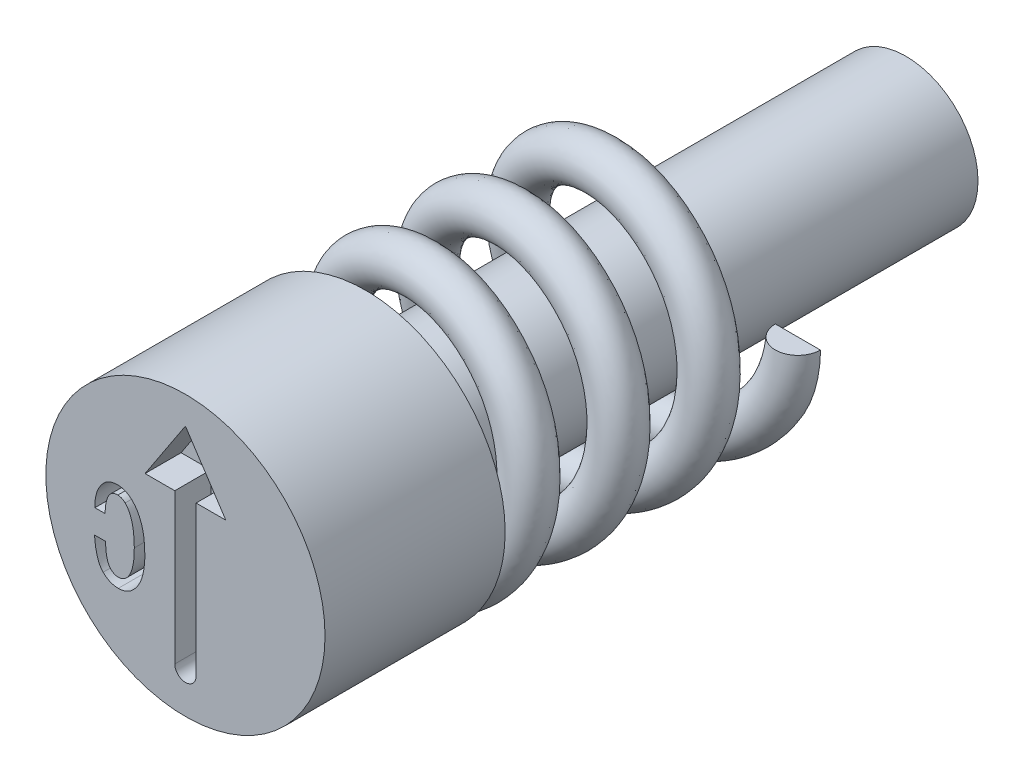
ISO-10303-21;
HEADER;
FILE_DESCRIPTION(('STEP AP214'),'2;1');
FILE_NAME('part.step','',(''),(''),'','','');
FILE_SCHEMA(('AUTOMOTIVE_DESIGN { 1 0 10303 214 1 1 1 1 }'));
ENDSEC;
DATA;
#1=APPLICATION_CONTEXT('core data for automotive mechanical design processes');
#2=APPLICATION_PROTOCOL_DEFINITION('international standard','automotive_design',2000,#1);
#3=PRODUCT_CONTEXT('',#1,'mechanical');
#4=PRODUCT('Part','Part','',(#3));
#5=PRODUCT_RELATED_PRODUCT_CATEGORY('part','',(#4));
#6=PRODUCT_DEFINITION_FORMATION('','',#4);
#7=PRODUCT_DEFINITION_CONTEXT('part definition',#1,'design');
#8=PRODUCT_DEFINITION('design','',#6,#7);
#9=PRODUCT_DEFINITION_SHAPE('','',#8);
#10=(LENGTH_UNIT() NAMED_UNIT(*) SI_UNIT(.MILLI.,.METRE.));
#11=(NAMED_UNIT(*) PLANE_ANGLE_UNIT() SI_UNIT($,.RADIAN.));
#12=(NAMED_UNIT(*) SI_UNIT($,.STERADIAN.) SOLID_ANGLE_UNIT());
#13=UNCERTAINTY_MEASURE_WITH_UNIT(LENGTH_MEASURE(1.E-05),#10,'distance_accuracy_value','');
#14=(GEOMETRIC_REPRESENTATION_CONTEXT(3) GLOBAL_UNCERTAINTY_ASSIGNED_CONTEXT((#13)) GLOBAL_UNIT_ASSIGNED_CONTEXT((#10,
#11,#12)) REPRESENTATION_CONTEXT('',''));
#15=CARTESIAN_POINT('',(0.,0.,0.));
#16=DIRECTION('',(0.,0.,1.));
#17=DIRECTION('',(1.,0.,0.));
#18=AXIS2_PLACEMENT_3D('',#15,#16,#17);
#19=CARTESIAN_POINT('',(1.3,0.,-5.75));
#20=DIRECTION('',(0.,-1.,0.));
#21=DIRECTION('',(0.,0.,-1.));
#22=AXIS2_PLACEMENT_3D('',#19,#20,#21);
#23=PLANE('',#22);
#24=CARTESIAN_POINT('',(1.3,0.,-5.5));
#25=DIRECTION('',(0.,1.,0.));
#26=DIRECTION('',(0.,0.,1.));
#27=AXIS2_PLACEMENT_3D('',#24,#25,#26);
#28=CIRCLE('',#27,0.25);
#29=CARTESIAN_POINT('',(1.05,0.,-5.5));
#30=VERTEX_POINT('',#29);
#31=CARTESIAN_POINT('',(1.55,0.,-5.5));
#32=VERTEX_POINT('',#31);
#33=EDGE_CURVE('E88',#30,#32,#28,.T.);
#34=ORIENTED_EDGE('',*,*,#33,.T.);
#35=DIRECTION('',(-1.,0.,0.));
#36=VECTOR('',#35,1.);
#37=CARTESIAN_POINT('',(1.3,0.,-5.5));
#38=LINE('',#37,#36);
#39=EDGE_CURVE('E75',#32,#30,#38,.T.);
#40=ORIENTED_EDGE('',*,*,#39,.T.);
#41=EDGE_LOOP('',(#34,#40));
#42=FACE_BOUND('',#41,.T.);
#43=ADVANCED_FACE('F49',(#42),#23,.F.);
#44=CARTESIAN_POINT('',(-1.3,0.,-2.25));
#45=DIRECTION('',(0.,1.,0.));
#46=DIRECTION('',(-1.,0.,0.));
#47=AXIS2_PLACEMENT_3D('',#44,#45,#46);
#48=PLANE('',#47);
#49=DIRECTION('',(-1.,0.,0.));
#50=VECTOR('',#49,1.);
#51=CARTESIAN_POINT('',(-1.3,0.,-2.));
#52=LINE('',#51,#50);
#53=CARTESIAN_POINT('',(-1.05,0.,-2.));
#54=VERTEX_POINT('',#53);
#55=CARTESIAN_POINT('',(-1.55,0.,-2.));
#56=VERTEX_POINT('',#55);
#57=EDGE_CURVE('E69',#54,#56,#52,.T.);
#58=ORIENTED_EDGE('',*,*,#57,.F.);
#59=CARTESIAN_POINT('',(-1.3,0.,-2.));
#60=DIRECTION('',(0.,1.,0.));
#61=DIRECTION('',(-1.,0.,0.));
#62=AXIS2_PLACEMENT_3D('',#59,#60,#61);
#63=CIRCLE('',#62,0.25);
#64=EDGE_CURVE('E85',#54,#56,#63,.T.);
#65=ORIENTED_EDGE('',*,*,#64,.T.);
#66=EDGE_LOOP('',(#58,#65));
#67=FACE_BOUND('',#66,.T.);
#68=ADVANCED_FACE('F51',(#67),#48,.T.);
#69=CARTESIAN_POINT('',(1.3,0.,-5.25));
#70=CARTESIAN_POINT('',(1.3,-0.538477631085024,-5.1875));
#71=CARTESIAN_POINT('',(0.919238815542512,-0.919238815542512,-5.125));
#72=CARTESIAN_POINT('',(0.538477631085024,-1.3,-5.0625));
#73=CARTESIAN_POINT('',(0.,-1.3,-5.));
#74=CARTESIAN_POINT('',(-0.538477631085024,-1.3,-4.9375));
#75=CARTESIAN_POINT('',(-0.919238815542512,-0.919238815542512,-4.875));
#76=CARTESIAN_POINT('',(-1.3,-0.538477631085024,-4.8125));
#77=CARTESIAN_POINT('',(-1.3,0.,-4.75));
#78=CARTESIAN_POINT('',(-1.3,0.538477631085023,-4.6875));
#79=CARTESIAN_POINT('',(-0.919238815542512,0.919238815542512,-4.625));
#80=CARTESIAN_POINT('',(-0.538477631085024,1.3,-4.5625));
#81=CARTESIAN_POINT('',(0.,1.3,-4.5));
#82=CARTESIAN_POINT('',(0.538477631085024,1.3,-4.4375));
#83=CARTESIAN_POINT('',(0.919238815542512,0.919238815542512,-4.375));
#84=CARTESIAN_POINT('',(1.3,0.538477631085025,-4.3125));
#85=CARTESIAN_POINT('',(1.3,0.,-4.25));
#86=CARTESIAN_POINT('',(1.3,-0.538477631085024,-4.1875));
#87=CARTESIAN_POINT('',(0.919238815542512,-0.919238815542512,-4.125));
#88=CARTESIAN_POINT('',(0.538477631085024,-1.3,-4.0625));
#89=CARTESIAN_POINT('',(0.,-1.3,-4.));
#90=CARTESIAN_POINT('',(-0.538477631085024,-1.3,-3.9375));
#91=CARTESIAN_POINT('',(-0.919238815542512,-0.919238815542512,-3.875));
#92=CARTESIAN_POINT('',(-1.3,-0.538477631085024,-3.8125));
#93=CARTESIAN_POINT('',(-1.3,0.,-3.75));
#94=CARTESIAN_POINT('',(-1.3,0.538477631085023,-3.6875));
#95=CARTESIAN_POINT('',(-0.919238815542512,0.919238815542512,-3.625));
#96=CARTESIAN_POINT('',(-0.538477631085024,1.3,-3.5625));
#97=CARTESIAN_POINT('',(0.,1.3,-3.5));
#98=CARTESIAN_POINT('',(0.538477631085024,1.3,-3.4375));
#99=CARTESIAN_POINT('',(0.919238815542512,0.919238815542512,-3.375));
#100=CARTESIAN_POINT('',(1.3,0.538477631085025,-3.3125));
#101=CARTESIAN_POINT('',(1.3,0.,-3.25));
#102=CARTESIAN_POINT('',(1.3,-0.538477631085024,-3.1875));
#103=CARTESIAN_POINT('',(0.919238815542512,-0.919238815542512,-3.125));
#104=CARTESIAN_POINT('',(0.538477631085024,-1.3,-3.0625));
#105=CARTESIAN_POINT('',(0.,-1.3,-3.));
#106=CARTESIAN_POINT('',(-0.538477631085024,-1.3,-2.9375));
#107=CARTESIAN_POINT('',(-0.919238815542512,-0.919238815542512,-2.875));
#108=CARTESIAN_POINT('',(-1.3,-0.538477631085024,-2.8125));
#109=CARTESIAN_POINT('',(-1.3,0.,-2.75));
#110=CARTESIAN_POINT('',(-1.3,0.538477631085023,-2.6875));
#111=CARTESIAN_POINT('',(-0.919238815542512,0.919238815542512,-2.625));
#112=CARTESIAN_POINT('',(-0.538477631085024,1.3,-2.5625));
#113=CARTESIAN_POINT('',(0.,1.3,-2.5));
#114=CARTESIAN_POINT('',(0.538477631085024,1.3,-2.4375));
#115=CARTESIAN_POINT('',(0.919238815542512,0.919238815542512,-2.375));
#116=CARTESIAN_POINT('',(1.3,0.538477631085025,-2.3125));
#117=CARTESIAN_POINT('',(1.3,0.,-2.25));
#118=CARTESIAN_POINT('',(1.3,-0.538477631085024,-2.1875));
#119=CARTESIAN_POINT('',(0.919238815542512,-0.919238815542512,-2.125));
#120=CARTESIAN_POINT('',(0.538477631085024,-1.3,-2.0625));
#121=CARTESIAN_POINT('',(0.,-1.3,-2.));
#122=CARTESIAN_POINT('',(-0.538477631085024,-1.3,-1.9375));
#123=CARTESIAN_POINT('',(-0.919238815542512,-0.919238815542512,-1.875));
#124=CARTESIAN_POINT('',(-1.3,-0.538477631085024,-1.8125));
#125=CARTESIAN_POINT('',(-1.3,0.,-1.75));
#126=CARTESIAN_POINT('',(1.8,0.,-5.25));
#127=CARTESIAN_POINT('',(1.8,-0.745584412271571,-5.1875));
#128=CARTESIAN_POINT('',(1.27279220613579,-1.27279220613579,-5.125));
#129=CARTESIAN_POINT('',(0.745584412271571,-1.8,-5.0625));
#130=CARTESIAN_POINT('',(0.,-1.8,-5.));
#131=CARTESIAN_POINT('',(-0.745584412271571,-1.8,-4.9375));
#132=CARTESIAN_POINT('',(-1.27279220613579,-1.27279220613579,-4.875));
#133=CARTESIAN_POINT('',(-1.8,-0.745584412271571,-4.8125));
#134=CARTESIAN_POINT('',(-1.8,0.,-4.75));
#135=CARTESIAN_POINT('',(-1.8,0.745584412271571,-4.6875));
#136=CARTESIAN_POINT('',(-1.27279220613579,1.27279220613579,-4.625));
#137=CARTESIAN_POINT('',(-0.745584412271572,1.8,-4.5625));
#138=CARTESIAN_POINT('',(0.,1.8,-4.5));
#139=CARTESIAN_POINT('',(0.745584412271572,1.8,-4.4375));
#140=CARTESIAN_POINT('',(1.27279220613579,1.27279220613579,-4.375));
#141=CARTESIAN_POINT('',(1.8,0.745584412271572,-4.3125));
#142=CARTESIAN_POINT('',(1.8,0.,-4.25));
#143=CARTESIAN_POINT('',(1.8,-0.745584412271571,-4.1875));
#144=CARTESIAN_POINT('',(1.27279220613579,-1.27279220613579,-4.125));
#145=CARTESIAN_POINT('',(0.745584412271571,-1.8,-4.0625));
#146=CARTESIAN_POINT('',(0.,-1.8,-4.));
#147=CARTESIAN_POINT('',(-0.745584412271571,-1.8,-3.9375));
#148=CARTESIAN_POINT('',(-1.27279220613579,-1.27279220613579,-3.875));
#149=CARTESIAN_POINT('',(-1.8,-0.745584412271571,-3.8125));
#150=CARTESIAN_POINT('',(-1.8,0.,-3.75));
#151=CARTESIAN_POINT('',(-1.8,0.745584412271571,-3.6875));
#152=CARTESIAN_POINT('',(-1.27279220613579,1.27279220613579,-3.625));
#153=CARTESIAN_POINT('',(-0.745584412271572,1.8,-3.5625));
#154=CARTESIAN_POINT('',(0.,1.8,-3.5));
#155=CARTESIAN_POINT('',(0.745584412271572,1.8,-3.4375));
#156=CARTESIAN_POINT('',(1.27279220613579,1.27279220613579,-3.375));
#157=CARTESIAN_POINT('',(1.8,0.745584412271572,-3.3125));
#158=CARTESIAN_POINT('',(1.8,0.,-3.25));
#159=CARTESIAN_POINT('',(1.8,-0.745584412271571,-3.1875));
#160=CARTESIAN_POINT('',(1.27279220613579,-1.27279220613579,-3.125));
#161=CARTESIAN_POINT('',(0.745584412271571,-1.8,-3.0625));
#162=CARTESIAN_POINT('',(0.,-1.8,-3.));
#163=CARTESIAN_POINT('',(-0.745584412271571,-1.8,-2.9375));
#164=CARTESIAN_POINT('',(-1.27279220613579,-1.27279220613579,-2.875));
#165=CARTESIAN_POINT('',(-1.8,-0.745584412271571,-2.8125));
#166=CARTESIAN_POINT('',(-1.8,0.,-2.75));
#167=CARTESIAN_POINT('',(-1.8,0.745584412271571,-2.6875));
#168=CARTESIAN_POINT('',(-1.27279220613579,1.27279220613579,-2.625));
#169=CARTESIAN_POINT('',(-0.745584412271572,1.8,-2.5625));
#170=CARTESIAN_POINT('',(0.,1.8,-2.5));
#171=CARTESIAN_POINT('',(0.745584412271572,1.8,-2.4375));
#172=CARTESIAN_POINT('',(1.27279220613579,1.27279220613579,-2.375));
#173=CARTESIAN_POINT('',(1.8,0.745584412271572,-2.3125));
#174=CARTESIAN_POINT('',(1.8,0.,-2.25));
#175=CARTESIAN_POINT('',(1.8,-0.745584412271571,-2.1875));
#176=CARTESIAN_POINT('',(1.27279220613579,-1.27279220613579,-2.125));
#177=CARTESIAN_POINT('',(0.745584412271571,-1.8,-2.0625));
#178=CARTESIAN_POINT('',(0.,-1.8,-2.));
#179=CARTESIAN_POINT('',(-0.745584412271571,-1.8,-1.9375));
#180=CARTESIAN_POINT('',(-1.27279220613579,-1.27279220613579,-1.875));
#181=CARTESIAN_POINT('',(-1.8,-0.745584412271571,-1.8125));
#182=CARTESIAN_POINT('',(-1.8,0.,-1.75));
#183=CARTESIAN_POINT('',(1.8,0.,-5.75));
#184=CARTESIAN_POINT('',(1.8,-0.745584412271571,-5.6875));
#185=CARTESIAN_POINT('',(1.27279220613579,-1.27279220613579,-5.625));
#186=CARTESIAN_POINT('',(0.745584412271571,-1.8,-5.5625));
#187=CARTESIAN_POINT('',(0.,-1.8,-5.5));
#188=CARTESIAN_POINT('',(-0.745584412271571,-1.8,-5.4375));
#189=CARTESIAN_POINT('',(-1.27279220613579,-1.27279220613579,-5.375));
#190=CARTESIAN_POINT('',(-1.8,-0.745584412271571,-5.3125));
#191=CARTESIAN_POINT('',(-1.8,0.,-5.25));
#192=CARTESIAN_POINT('',(-1.8,0.745584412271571,-5.1875));
#193=CARTESIAN_POINT('',(-1.27279220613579,1.27279220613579,-5.125));
#194=CARTESIAN_POINT('',(-0.745584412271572,1.8,-5.0625));
#195=CARTESIAN_POINT('',(0.,1.8,-5.));
#196=CARTESIAN_POINT('',(0.745584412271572,1.8,-4.9375));
#197=CARTESIAN_POINT('',(1.27279220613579,1.27279220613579,-4.875));
#198=CARTESIAN_POINT('',(1.8,0.745584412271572,-4.8125));
#199=CARTESIAN_POINT('',(1.8,0.,-4.75));
#200=CARTESIAN_POINT('',(1.8,-0.745584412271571,-4.6875));
#201=CARTESIAN_POINT('',(1.27279220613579,-1.27279220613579,-4.625));
#202=CARTESIAN_POINT('',(0.745584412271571,-1.8,-4.5625));
#203=CARTESIAN_POINT('',(0.,-1.8,-4.5));
#204=CARTESIAN_POINT('',(-0.745584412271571,-1.8,-4.4375));
#205=CARTESIAN_POINT('',(-1.27279220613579,-1.27279220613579,-4.375));
#206=CARTESIAN_POINT('',(-1.8,-0.745584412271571,-4.3125));
#207=CARTESIAN_POINT('',(-1.8,0.,-4.25));
#208=CARTESIAN_POINT('',(-1.8,0.745584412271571,-4.1875));
#209=CARTESIAN_POINT('',(-1.27279220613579,1.27279220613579,-4.125));
#210=CARTESIAN_POINT('',(-0.745584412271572,1.8,-4.0625));
#211=CARTESIAN_POINT('',(0.,1.8,-4.));
#212=CARTESIAN_POINT('',(0.745584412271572,1.8,-3.9375));
#213=CARTESIAN_POINT('',(1.27279220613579,1.27279220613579,-3.875));
#214=CARTESIAN_POINT('',(1.8,0.745584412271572,-3.8125));
#215=CARTESIAN_POINT('',(1.8,0.,-3.75));
#216=CARTESIAN_POINT('',(1.8,-0.745584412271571,-3.6875));
#217=CARTESIAN_POINT('',(1.27279220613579,-1.27279220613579,-3.625));
#218=CARTESIAN_POINT('',(0.745584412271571,-1.8,-3.5625));
#219=CARTESIAN_POINT('',(0.,-1.8,-3.5));
#220=CARTESIAN_POINT('',(-0.745584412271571,-1.8,-3.4375));
#221=CARTESIAN_POINT('',(-1.27279220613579,-1.27279220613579,-3.375));
#222=CARTESIAN_POINT('',(-1.8,-0.745584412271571,-3.3125));
#223=CARTESIAN_POINT('',(-1.8,0.,-3.25));
#224=CARTESIAN_POINT('',(-1.8,0.745584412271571,-3.1875));
#225=CARTESIAN_POINT('',(-1.27279220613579,1.27279220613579,-3.125));
#226=CARTESIAN_POINT('',(-0.745584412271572,1.8,-3.0625));
#227=CARTESIAN_POINT('',(0.,1.8,-3.));
#228=CARTESIAN_POINT('',(0.745584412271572,1.8,-2.9375));
#229=CARTESIAN_POINT('',(1.27279220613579,1.27279220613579,-2.875));
#230=CARTESIAN_POINT('',(1.8,0.745584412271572,-2.8125));
#231=CARTESIAN_POINT('',(1.8,0.,-2.75));
#232=CARTESIAN_POINT('',(1.8,-0.745584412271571,-2.6875));
#233=CARTESIAN_POINT('',(1.27279220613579,-1.27279220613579,-2.625));
#234=CARTESIAN_POINT('',(0.745584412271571,-1.8,-2.5625));
#235=CARTESIAN_POINT('',(0.,-1.8,-2.5));
#236=CARTESIAN_POINT('',(-0.745584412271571,-1.8,-2.4375));
#237=CARTESIAN_POINT('',(-1.27279220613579,-1.27279220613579,-2.375));
#238=CARTESIAN_POINT('',(-1.8,-0.745584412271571,-2.3125));
#239=CARTESIAN_POINT('',(-1.8,0.,-2.25));
#240=CARTESIAN_POINT('',(1.3,0.,-5.75));
#241=CARTESIAN_POINT('',(1.3,-0.538477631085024,-5.6875));
#242=CARTESIAN_POINT('',(0.919238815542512,-0.919238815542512,-5.625));
#243=CARTESIAN_POINT('',(0.538477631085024,-1.3,-5.5625));
#244=CARTESIAN_POINT('',(0.,-1.3,-5.5));
#245=CARTESIAN_POINT('',(-0.538477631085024,-1.3,-5.4375));
#246=CARTESIAN_POINT('',(-0.919238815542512,-0.919238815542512,-5.375));
#247=CARTESIAN_POINT('',(-1.3,-0.538477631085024,-5.3125));
#248=CARTESIAN_POINT('',(-1.3,0.,-5.25));
#249=CARTESIAN_POINT('',(-1.3,0.538477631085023,-5.1875));
#250=CARTESIAN_POINT('',(-0.919238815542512,0.919238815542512,-5.125));
#251=CARTESIAN_POINT('',(-0.538477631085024,1.3,-5.0625));
#252=CARTESIAN_POINT('',(0.,1.3,-5.));
#253=CARTESIAN_POINT('',(0.538477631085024,1.3,-4.9375));
#254=CARTESIAN_POINT('',(0.919238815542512,0.919238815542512,-4.875));
#255=CARTESIAN_POINT('',(1.3,0.538477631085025,-4.8125));
#256=CARTESIAN_POINT('',(1.3,0.,-4.75));
#257=CARTESIAN_POINT('',(1.3,-0.538477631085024,-4.6875));
#258=CARTESIAN_POINT('',(0.919238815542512,-0.919238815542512,-4.625));
#259=CARTESIAN_POINT('',(0.538477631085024,-1.3,-4.5625));
#260=CARTESIAN_POINT('',(0.,-1.3,-4.5));
#261=CARTESIAN_POINT('',(-0.538477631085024,-1.3,-4.4375));
#262=CARTESIAN_POINT('',(-0.919238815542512,-0.919238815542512,-4.375));
#263=CARTESIAN_POINT('',(-1.3,-0.538477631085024,-4.3125));
#264=CARTESIAN_POINT('',(-1.3,0.,-4.25));
#265=CARTESIAN_POINT('',(-1.3,0.538477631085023,-4.1875));
#266=CARTESIAN_POINT('',(-0.919238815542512,0.919238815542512,-4.125));
#267=CARTESIAN_POINT('',(-0.538477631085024,1.3,-4.0625));
#268=CARTESIAN_POINT('',(0.,1.3,-4.));
#269=CARTESIAN_POINT('',(0.538477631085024,1.3,-3.9375));
#270=CARTESIAN_POINT('',(0.919238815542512,0.919238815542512,-3.875));
#271=CARTESIAN_POINT('',(1.3,0.538477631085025,-3.8125));
#272=CARTESIAN_POINT('',(1.3,0.,-3.75));
#273=CARTESIAN_POINT('',(1.3,-0.538477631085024,-3.6875));
#274=CARTESIAN_POINT('',(0.919238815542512,-0.919238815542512,-3.625));
#275=CARTESIAN_POINT('',(0.538477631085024,-1.3,-3.5625));
#276=CARTESIAN_POINT('',(0.,-1.3,-3.5));
#277=CARTESIAN_POINT('',(-0.538477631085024,-1.3,-3.4375));
#278=CARTESIAN_POINT('',(-0.919238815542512,-0.919238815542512,-3.375));
#279=CARTESIAN_POINT('',(-1.3,-0.538477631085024,-3.3125));
#280=CARTESIAN_POINT('',(-1.3,0.,-3.25));
#281=CARTESIAN_POINT('',(-1.3,0.538477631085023,-3.1875));
#282=CARTESIAN_POINT('',(-0.919238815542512,0.919238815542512,-3.125));
#283=CARTESIAN_POINT('',(-0.538477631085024,1.3,-3.0625));
#284=CARTESIAN_POINT('',(0.,1.3,-3.));
#285=CARTESIAN_POINT('',(0.538477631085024,1.3,-2.9375));
#286=CARTESIAN_POINT('',(0.919238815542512,0.919238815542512,-2.875));
#287=CARTESIAN_POINT('',(1.3,0.538477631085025,-2.8125));
#288=CARTESIAN_POINT('',(1.3,0.,-2.75));
#289=CARTESIAN_POINT('',(1.3,-0.538477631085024,-2.6875));
#290=CARTESIAN_POINT('',(0.919238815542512,-0.919238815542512,-2.625));
#291=CARTESIAN_POINT('',(0.538477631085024,-1.3,-2.5625));
#292=CARTESIAN_POINT('',(0.,-1.3,-2.5));
#293=CARTESIAN_POINT('',(-0.538477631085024,-1.3,-2.4375));
#294=CARTESIAN_POINT('',(-0.919238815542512,-0.919238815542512,-2.375));
#295=CARTESIAN_POINT('',(-1.3,-0.538477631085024,-2.3125));
#296=CARTESIAN_POINT('',(-1.3,0.,-2.25));
#297=CARTESIAN_POINT('',(0.8,0.,-5.75));
#298=CARTESIAN_POINT('',(0.8,-0.331370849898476,-5.6875));
#299=CARTESIAN_POINT('',(0.565685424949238,-0.565685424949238,-5.625));
#300=CARTESIAN_POINT('',(0.331370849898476,-0.8,-5.5625));
#301=CARTESIAN_POINT('',(0.,-0.8,-5.5));
#302=CARTESIAN_POINT('',(-0.331370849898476,-0.8,-5.4375));
#303=CARTESIAN_POINT('',(-0.565685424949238,-0.565685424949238,-5.375));
#304=CARTESIAN_POINT('',(-0.8,-0.331370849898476,-5.3125));
#305=CARTESIAN_POINT('',(-0.8,0.,-5.25));
#306=CARTESIAN_POINT('',(-0.8,0.331370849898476,-5.1875));
#307=CARTESIAN_POINT('',(-0.565685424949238,0.565685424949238,-5.125));
#308=CARTESIAN_POINT('',(-0.331370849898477,0.8,-5.0625));
#309=CARTESIAN_POINT('',(0.,0.8,-5.));
#310=CARTESIAN_POINT('',(0.331370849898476,0.8,-4.9375));
#311=CARTESIAN_POINT('',(0.565685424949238,0.565685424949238,-4.875));
#312=CARTESIAN_POINT('',(0.8,0.331370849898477,-4.8125));
#313=CARTESIAN_POINT('',(0.8,0.,-4.75));
#314=CARTESIAN_POINT('',(0.8,-0.331370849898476,-4.6875));
#315=CARTESIAN_POINT('',(0.565685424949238,-0.565685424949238,-4.625));
#316=CARTESIAN_POINT('',(0.331370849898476,-0.8,-4.5625));
#317=CARTESIAN_POINT('',(0.,-0.8,-4.5));
#318=CARTESIAN_POINT('',(-0.331370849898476,-0.8,-4.4375));
#319=CARTESIAN_POINT('',(-0.565685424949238,-0.565685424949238,-4.375));
#320=CARTESIAN_POINT('',(-0.8,-0.331370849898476,-4.3125));
#321=CARTESIAN_POINT('',(-0.8,0.,-4.25));
#322=CARTESIAN_POINT('',(-0.8,0.331370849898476,-4.1875));
#323=CARTESIAN_POINT('',(-0.565685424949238,0.565685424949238,-4.125));
#324=CARTESIAN_POINT('',(-0.331370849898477,0.8,-4.0625));
#325=CARTESIAN_POINT('',(0.,0.8,-4.));
#326=CARTESIAN_POINT('',(0.331370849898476,0.8,-3.9375));
#327=CARTESIAN_POINT('',(0.565685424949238,0.565685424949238,-3.875));
#328=CARTESIAN_POINT('',(0.8,0.331370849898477,-3.8125));
#329=CARTESIAN_POINT('',(0.8,0.,-3.75));
#330=CARTESIAN_POINT('',(0.8,-0.331370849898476,-3.6875));
#331=CARTESIAN_POINT('',(0.565685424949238,-0.565685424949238,-3.625));
#332=CARTESIAN_POINT('',(0.331370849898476,-0.8,-3.5625));
#333=CARTESIAN_POINT('',(0.,-0.8,-3.5));
#334=CARTESIAN_POINT('',(-0.331370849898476,-0.8,-3.4375));
#335=CARTESIAN_POINT('',(-0.565685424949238,-0.565685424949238,-3.375));
#336=CARTESIAN_POINT('',(-0.8,-0.331370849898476,-3.3125));
#337=CARTESIAN_POINT('',(-0.8,0.,-3.25));
#338=CARTESIAN_POINT('',(-0.8,0.331370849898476,-3.1875));
#339=CARTESIAN_POINT('',(-0.565685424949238,0.565685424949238,-3.125));
#340=CARTESIAN_POINT('',(-0.331370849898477,0.8,-3.0625));
#341=CARTESIAN_POINT('',(0.,0.8,-3.));
#342=CARTESIAN_POINT('',(0.331370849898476,0.8,-2.9375));
#343=CARTESIAN_POINT('',(0.565685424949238,0.565685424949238,-2.875));
#344=CARTESIAN_POINT('',(0.8,0.331370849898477,-2.8125));
#345=CARTESIAN_POINT('',(0.8,0.,-2.75));
#346=CARTESIAN_POINT('',(0.8,-0.331370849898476,-2.6875));
#347=CARTESIAN_POINT('',(0.565685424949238,-0.565685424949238,-2.625));
#348=CARTESIAN_POINT('',(0.331370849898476,-0.8,-2.5625));
#349=CARTESIAN_POINT('',(0.,-0.8,-2.5));
#350=CARTESIAN_POINT('',(-0.331370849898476,-0.8,-2.4375));
#351=CARTESIAN_POINT('',(-0.565685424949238,-0.565685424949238,-2.375));
#352=CARTESIAN_POINT('',(-0.8,-0.331370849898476,-2.3125));
#353=CARTESIAN_POINT('',(-0.8,0.,-2.25));
#354=CARTESIAN_POINT('',(0.8,0.,-5.25));
#355=CARTESIAN_POINT('',(0.8,-0.331370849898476,-5.1875));
#356=CARTESIAN_POINT('',(0.565685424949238,-0.565685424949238,-5.125));
#357=CARTESIAN_POINT('',(0.331370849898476,-0.8,-5.0625));
#358=CARTESIAN_POINT('',(0.,-0.8,-5.));
#359=CARTESIAN_POINT('',(-0.331370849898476,-0.8,-4.9375));
#360=CARTESIAN_POINT('',(-0.565685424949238,-0.565685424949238,-4.875));
#361=CARTESIAN_POINT('',(-0.8,-0.331370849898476,-4.8125));
#362=CARTESIAN_POINT('',(-0.8,0.,-4.75));
#363=CARTESIAN_POINT('',(-0.8,0.331370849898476,-4.6875));
#364=CARTESIAN_POINT('',(-0.565685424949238,0.565685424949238,-4.625));
#365=CARTESIAN_POINT('',(-0.331370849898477,0.8,-4.5625));
#366=CARTESIAN_POINT('',(0.,0.8,-4.5));
#367=CARTESIAN_POINT('',(0.331370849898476,0.8,-4.4375));
#368=CARTESIAN_POINT('',(0.565685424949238,0.565685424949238,-4.375));
#369=CARTESIAN_POINT('',(0.8,0.331370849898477,-4.3125));
#370=CARTESIAN_POINT('',(0.8,0.,-4.25));
#371=CARTESIAN_POINT('',(0.8,-0.331370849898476,-4.1875));
#372=CARTESIAN_POINT('',(0.565685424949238,-0.565685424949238,-4.125));
#373=CARTESIAN_POINT('',(0.331370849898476,-0.8,-4.0625));
#374=CARTESIAN_POINT('',(0.,-0.8,-4.));
#375=CARTESIAN_POINT('',(-0.331370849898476,-0.8,-3.9375));
#376=CARTESIAN_POINT('',(-0.565685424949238,-0.565685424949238,-3.875));
#377=CARTESIAN_POINT('',(-0.8,-0.331370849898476,-3.8125));
#378=CARTESIAN_POINT('',(-0.8,0.,-3.75));
#379=CARTESIAN_POINT('',(-0.8,0.331370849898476,-3.6875));
#380=CARTESIAN_POINT('',(-0.565685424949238,0.565685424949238,-3.625));
#381=CARTESIAN_POINT('',(-0.331370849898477,0.8,-3.5625));
#382=CARTESIAN_POINT('',(0.,0.8,-3.5));
#383=CARTESIAN_POINT('',(0.331370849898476,0.8,-3.4375));
#384=CARTESIAN_POINT('',(0.565685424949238,0.565685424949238,-3.375));
#385=CARTESIAN_POINT('',(0.8,0.331370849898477,-3.3125));
#386=CARTESIAN_POINT('',(0.8,0.,-3.25));
#387=CARTESIAN_POINT('',(0.8,-0.331370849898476,-3.1875));
#388=CARTESIAN_POINT('',(0.565685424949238,-0.565685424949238,-3.125));
#389=CARTESIAN_POINT('',(0.331370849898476,-0.8,-3.0625));
#390=CARTESIAN_POINT('',(0.,-0.8,-3.));
#391=CARTESIAN_POINT('',(-0.331370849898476,-0.8,-2.9375));
#392=CARTESIAN_POINT('',(-0.565685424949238,-0.565685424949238,-2.875));
#393=CARTESIAN_POINT('',(-0.8,-0.331370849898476,-2.8125));
#394=CARTESIAN_POINT('',(-0.8,0.,-2.75));
#395=CARTESIAN_POINT('',(-0.8,0.331370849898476,-2.6875));
#396=CARTESIAN_POINT('',(-0.565685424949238,0.565685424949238,-2.625));
#397=CARTESIAN_POINT('',(-0.331370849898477,0.8,-2.5625));
#398=CARTESIAN_POINT('',(0.,0.8,-2.5));
#399=CARTESIAN_POINT('',(0.331370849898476,0.8,-2.4375));
#400=CARTESIAN_POINT('',(0.565685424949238,0.565685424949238,-2.375));
#401=CARTESIAN_POINT('',(0.8,0.331370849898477,-2.3125));
#402=CARTESIAN_POINT('',(0.8,0.,-2.25));
#403=CARTESIAN_POINT('',(0.8,-0.331370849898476,-2.1875));
#404=CARTESIAN_POINT('',(0.565685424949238,-0.565685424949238,-2.125));
#405=CARTESIAN_POINT('',(0.331370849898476,-0.8,-2.0625));
#406=CARTESIAN_POINT('',(0.,-0.8,-2.));
#407=CARTESIAN_POINT('',(-0.331370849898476,-0.8,-1.9375));
#408=CARTESIAN_POINT('',(-0.565685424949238,-0.565685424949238,-1.875));
#409=CARTESIAN_POINT('',(-0.8,-0.331370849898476,-1.8125));
#410=CARTESIAN_POINT('',(-0.8,0.,-1.75));
#411=CARTESIAN_POINT('',(1.3,0.,-5.25));
#412=CARTESIAN_POINT('',(1.3,-0.538477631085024,-5.1875));
#413=CARTESIAN_POINT('',(0.919238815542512,-0.919238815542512,-5.125));
#414=CARTESIAN_POINT('',(0.538477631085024,-1.3,-5.0625));
#415=CARTESIAN_POINT('',(0.,-1.3,-5.));
#416=CARTESIAN_POINT('',(-0.538477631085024,-1.3,-4.9375));
#417=CARTESIAN_POINT('',(-0.919238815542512,-0.919238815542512,-4.875));
#418=CARTESIAN_POINT('',(-1.3,-0.538477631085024,-4.8125));
#419=CARTESIAN_POINT('',(-1.3,0.,-4.75));
#420=CARTESIAN_POINT('',(-1.3,0.538477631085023,-4.6875));
#421=CARTESIAN_POINT('',(-0.919238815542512,0.919238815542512,-4.625));
#422=CARTESIAN_POINT('',(-0.538477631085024,1.3,-4.5625));
#423=CARTESIAN_POINT('',(0.,1.3,-4.5));
#424=CARTESIAN_POINT('',(0.538477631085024,1.3,-4.4375));
#425=CARTESIAN_POINT('',(0.919238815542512,0.919238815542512,-4.375));
#426=CARTESIAN_POINT('',(1.3,0.538477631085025,-4.3125));
#427=CARTESIAN_POINT('',(1.3,0.,-4.25));
#428=CARTESIAN_POINT('',(1.3,-0.538477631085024,-4.1875));
#429=CARTESIAN_POINT('',(0.919238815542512,-0.919238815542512,-4.125));
#430=CARTESIAN_POINT('',(0.538477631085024,-1.3,-4.0625));
#431=CARTESIAN_POINT('',(0.,-1.3,-4.));
#432=CARTESIAN_POINT('',(-0.538477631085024,-1.3,-3.9375));
#433=CARTESIAN_POINT('',(-0.919238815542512,-0.919238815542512,-3.875));
#434=CARTESIAN_POINT('',(-1.3,-0.538477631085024,-3.8125));
#435=CARTESIAN_POINT('',(-1.3,0.,-3.75));
#436=CARTESIAN_POINT('',(-1.3,0.538477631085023,-3.6875));
#437=CARTESIAN_POINT('',(-0.919238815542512,0.919238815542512,-3.625));
#438=CARTESIAN_POINT('',(-0.538477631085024,1.3,-3.5625));
#439=CARTESIAN_POINT('',(0.,1.3,-3.5));
#440=CARTESIAN_POINT('',(0.538477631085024,1.3,-3.4375));
#441=CARTESIAN_POINT('',(0.919238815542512,0.919238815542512,-3.375));
#442=CARTESIAN_POINT('',(1.3,0.538477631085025,-3.3125));
#443=CARTESIAN_POINT('',(1.3,0.,-3.25));
#444=CARTESIAN_POINT('',(1.3,-0.538477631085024,-3.1875));
#445=CARTESIAN_POINT('',(0.919238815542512,-0.919238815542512,-3.125));
#446=CARTESIAN_POINT('',(0.538477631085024,-1.3,-3.0625));
#447=CARTESIAN_POINT('',(0.,-1.3,-3.));
#448=CARTESIAN_POINT('',(-0.538477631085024,-1.3,-2.9375));
#449=CARTESIAN_POINT('',(-0.919238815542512,-0.919238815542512,-2.875));
#450=CARTESIAN_POINT('',(-1.3,-0.538477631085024,-2.8125));
#451=CARTESIAN_POINT('',(-1.3,0.,-2.75));
#452=CARTESIAN_POINT('',(-1.3,0.538477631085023,-2.6875));
#453=CARTESIAN_POINT('',(-0.919238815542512,0.919238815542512,-2.625));
#454=CARTESIAN_POINT('',(-0.538477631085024,1.3,-2.5625));
#455=CARTESIAN_POINT('',(0.,1.3,-2.5));
#456=CARTESIAN_POINT('',(0.538477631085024,1.3,-2.4375));
#457=CARTESIAN_POINT('',(0.919238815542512,0.919238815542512,-2.375));
#458=CARTESIAN_POINT('',(1.3,0.538477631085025,-2.3125));
#459=CARTESIAN_POINT('',(1.3,0.,-2.25));
#460=CARTESIAN_POINT('',(1.3,-0.538477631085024,-2.1875));
#461=CARTESIAN_POINT('',(0.919238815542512,-0.919238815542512,-2.125));
#462=CARTESIAN_POINT('',(0.538477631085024,-1.3,-2.0625));
#463=CARTESIAN_POINT('',(0.,-1.3,-2.));
#464=CARTESIAN_POINT('',(-0.538477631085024,-1.3,-1.9375));
#465=CARTESIAN_POINT('',(-0.919238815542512,-0.919238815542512,-1.875));
#466=CARTESIAN_POINT('',(-1.3,-0.538477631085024,-1.8125));
#467=CARTESIAN_POINT('',(-1.3,0.,-1.75));
#468=(BOUNDED_SURFACE() B_SPLINE_SURFACE(3,2,((#69,#70,#71,#72,#73,#74,#75,#76,#77,#78,#79,#80,
#81,#82,#83,#84,#85,#86,#87,#88,#89,#90,#91,#92,#93,#94,#95,#96,#97,#98,#99,#100,#101,#102,#103,
#104,#105,#106,#107,#108,#109,#110,#111,#112,#113,#114,#115,#116,#117,#118,#119,#120,#121,#122,
#123,#124,#125),(#126,#127,#128,#129,#130,#131,#132,#133,#134,#135,#136,#137,#138,#139,#140,
#141,#142,#143,#144,#145,#146,#147,#148,#149,#150,#151,#152,#153,#154,#155,#156,#157,#158,#159,
#160,#161,#162,#163,#164,#165,#166,#167,#168,#169,#170,#171,#172,#173,#174,#175,#176,#177,#178,
#179,#180,#181,#182),(#183,#184,#185,#186,#187,#188,#189,#190,#191,#192,#193,#194,#195,#196,
#197,#198,#199,#200,#201,#202,#203,#204,#205,#206,#207,#208,#209,#210,#211,#212,#213,#214,#215,
#216,#217,#218,#219,#220,#221,#222,#223,#224,#225,#226,#227,#228,#229,#230,#231,#232,#233,#234,
#235,#236,#237,#238,#239),(#240,#241,#242,#243,#244,#245,#246,#247,#248,#249,#250,#251,#252,
#253,#254,#255,#256,#257,#258,#259,#260,#261,#262,#263,#264,#265,#266,#267,#268,#269,#270,#271,
#272,#273,#274,#275,#276,#277,#278,#279,#280,#281,#282,#283,#284,#285,#286,#287,#288,#289,#290,
#291,#292,#293,#294,#295,#296),(#297,#298,#299,#300,#301,#302,#303,#304,#305,#306,#307,#308,
#309,#310,#311,#312,#313,#314,#315,#316,#317,#318,#319,#320,#321,#322,#323,#324,#325,#326,#327,
#328,#329,#330,#331,#332,#333,#334,#335,#336,#337,#338,#339,#340,#341,#342,#343,#344,#345,#346,
#347,#348,#349,#350,#351,#352,#353),(#354,#355,#356,#357,#358,#359,#360,#361,#362,#363,#364,
#365,#366,#367,#368,#369,#370,#371,#372,#373,#374,#375,#376,#377,#378,#379,#380,#381,#382,#383,
#384,#385,#386,#387,#388,#389,#390,#391,#392,#393,#394,#395,#396,#397,#398,#399,#400,#401,#402,
#403,#404,#405,#406,#407,#408,#409,#410),(#411,#412,#413,#414,#415,#416,#417,#418,#419,#420,
#421,#422,#423,#424,#425,#426,#427,#428,#429,#430,#431,#432,#433,#434,#435,#436,#437,#438,#439,
#440,#441,#442,#443,#444,#445,#446,#447,#448,#449,#450,#451,#452,#453,#454,#455,#456,#457,#458,
#459,#460,#461,#462,#463,#464,#465,#466,#467)),.UNSPECIFIED.,.T.,.F.,
.F.) B_SPLINE_SURFACE_WITH_KNOTS((4,3,4),(3,2,2,2,2,2,2,2,2,2,2,2,2,2,2,2,2,2,2,2,2,2,2,2,2,2,2,
2,3),(0.,0.5,1.),(0.,0.03125,0.0625,0.09375,0.125,0.15625,0.1875,0.21875,0.25,0.28125,0.3125,
0.34375,0.375,0.40625,0.4375,0.46875,0.5,0.53125,0.5625,0.59375,0.625,0.65625,0.6875,0.71875,
0.75,0.78125,0.8125,0.84375,0.875),
.UNSPECIFIED.) GEOMETRIC_REPRESENTATION_ITEM() RATIONAL_B_SPLINE_SURFACE(((1.,0.923879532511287,
1.,0.923879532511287,1.,0.923879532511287,1.,0.923879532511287,1.,0.923879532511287,1.,
0.923879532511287,1.,0.923879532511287,1.,0.923879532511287,1.,0.923879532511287,1.,
0.923879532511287,1.,0.923879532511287,1.,0.923879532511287,1.,0.923879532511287,1.,
0.923879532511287,1.,0.923879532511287,1.,0.923879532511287,1.,0.923879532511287,1.,
0.923879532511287,1.,0.923879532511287,1.,0.923879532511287,1.,0.923879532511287,1.,
0.923879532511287,1.,0.923879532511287,1.,0.923879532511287,1.,0.923879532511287,1.,
0.923879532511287,1.,0.923879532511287,1.,0.923879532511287,1.),(0.333333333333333,
0.307959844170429,0.333333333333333,0.307959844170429,0.333333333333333,0.307959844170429,
0.333333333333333,0.307959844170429,0.333333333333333,0.307959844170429,0.333333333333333,
0.307959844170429,0.333333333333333,0.307959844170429,0.333333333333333,0.307959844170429,
0.333333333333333,0.307959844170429,0.333333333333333,0.307959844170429,0.333333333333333,
0.307959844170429,0.333333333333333,0.307959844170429,0.333333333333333,0.307959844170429,
0.333333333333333,0.307959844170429,0.333333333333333,0.307959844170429,0.333333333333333,
0.307959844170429,0.333333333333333,0.307959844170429,0.333333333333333,0.307959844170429,
0.333333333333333,0.307959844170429,0.333333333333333,0.307959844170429,0.333333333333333,
0.307959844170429,0.333333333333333,0.307959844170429,0.333333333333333,0.307959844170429,
0.333333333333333,0.307959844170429,0.333333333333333,0.307959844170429,0.333333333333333,
0.307959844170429,0.333333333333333,0.307959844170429,0.333333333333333,0.307959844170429,
0.333333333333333),(0.333333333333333,0.307959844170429,0.333333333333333,0.307959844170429,
0.333333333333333,0.307959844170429,0.333333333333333,0.307959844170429,0.333333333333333,
0.307959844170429,0.333333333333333,0.307959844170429,0.333333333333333,0.307959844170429,
0.333333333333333,0.307959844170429,0.333333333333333,0.307959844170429,0.333333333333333,
0.307959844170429,0.333333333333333,0.307959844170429,0.333333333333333,0.307959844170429,
0.333333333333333,0.307959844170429,0.333333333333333,0.307959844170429,0.333333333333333,
0.307959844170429,0.333333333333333,0.307959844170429,0.333333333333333,0.307959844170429,
0.333333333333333,0.307959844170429,0.333333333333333,0.307959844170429,0.333333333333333,
0.307959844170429,0.333333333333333,0.307959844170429,0.333333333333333,0.307959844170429,
0.333333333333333,0.307959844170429,0.333333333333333,0.307959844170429,0.333333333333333,
0.307959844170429,0.333333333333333,0.307959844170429,0.333333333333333,0.307959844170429,
0.333333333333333,0.307959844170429,0.333333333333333),(1.,0.923879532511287,1.,
0.923879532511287,1.,0.923879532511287,1.,0.923879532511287,1.,0.923879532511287,1.,
0.923879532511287,1.,0.923879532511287,1.,0.923879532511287,1.,0.923879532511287,1.,
0.923879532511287,1.,0.923879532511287,1.,0.923879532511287,1.,0.923879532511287,1.,
0.923879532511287,1.,0.923879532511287,1.,0.923879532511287,1.,0.923879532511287,1.,
0.923879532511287,1.,0.923879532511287,1.,0.923879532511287,1.,0.923879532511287,1.,
0.923879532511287,1.,0.923879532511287,1.,0.923879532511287,1.,0.923879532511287,1.,
0.923879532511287,1.,0.923879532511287,1.,0.923879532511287,1.),(0.333333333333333,
0.307959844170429,0.333333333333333,0.307959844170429,0.333333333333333,0.307959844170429,
0.333333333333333,0.307959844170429,0.333333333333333,0.307959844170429,0.333333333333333,
0.307959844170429,0.333333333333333,0.307959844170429,0.333333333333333,0.307959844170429,
0.333333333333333,0.307959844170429,0.333333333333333,0.307959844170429,0.333333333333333,
0.307959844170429,0.333333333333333,0.307959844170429,0.333333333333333,0.307959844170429,
0.333333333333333,0.307959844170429,0.333333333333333,0.307959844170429,0.333333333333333,
0.307959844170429,0.333333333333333,0.307959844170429,0.333333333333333,0.307959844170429,
0.333333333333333,0.307959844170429,0.333333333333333,0.307959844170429,0.333333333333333,
0.307959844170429,0.333333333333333,0.307959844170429,0.333333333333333,0.307959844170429,
0.333333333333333,0.307959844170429,0.333333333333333,0.307959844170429,0.333333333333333,
0.307959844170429,0.333333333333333,0.307959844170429,0.333333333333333,0.307959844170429,
0.333333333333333),(0.333333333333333,0.307959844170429,0.333333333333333,0.307959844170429,
0.333333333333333,0.307959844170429,0.333333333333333,0.307959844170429,0.333333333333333,
0.307959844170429,0.333333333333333,0.307959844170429,0.333333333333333,0.307959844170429,
0.333333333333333,0.307959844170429,0.333333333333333,0.307959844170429,0.333333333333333,
0.307959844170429,0.333333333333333,0.307959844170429,0.333333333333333,0.307959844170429,
0.333333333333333,0.307959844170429,0.333333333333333,0.307959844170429,0.333333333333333,
0.307959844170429,0.333333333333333,0.307959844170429,0.333333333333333,0.307959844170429,
0.333333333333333,0.307959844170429,0.333333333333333,0.307959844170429,0.333333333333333,
0.307959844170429,0.333333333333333,0.307959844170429,0.333333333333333,0.307959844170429,
0.333333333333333,0.307959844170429,0.333333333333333,0.307959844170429,0.333333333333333,
0.307959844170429,0.333333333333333,0.307959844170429,0.333333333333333,0.307959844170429,
0.333333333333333,0.307959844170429,0.333333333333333),(1.,0.923879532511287,1.,
0.923879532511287,1.,0.923879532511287,1.,0.923879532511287,1.,0.923879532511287,1.,
0.923879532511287,1.,0.923879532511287,1.,0.923879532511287,1.,0.923879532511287,1.,
0.923879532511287,1.,0.923879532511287,1.,0.923879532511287,1.,0.923879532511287,1.,
0.923879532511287,1.,0.923879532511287,1.,0.923879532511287,1.,0.923879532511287,1.,
0.923879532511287,1.,0.923879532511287,1.,0.923879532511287,1.,0.923879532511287,1.,
0.923879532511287,1.,0.923879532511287,1.,0.923879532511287,1.,0.923879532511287,1.,
0.923879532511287,1.,0.923879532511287,1.,0.923879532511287,1.))) REPRESENTATION_ITEM('') SURFACE());
#469=CARTESIAN_POINT('',(1.05,0.,-5.5));
#470=CARTESIAN_POINT('',(1.05004023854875,-0.065567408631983,-5.5));
#471=CARTESIAN_POINT('',(1.04439509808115,-0.131091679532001,-5.5));
#472=CARTESIAN_POINT('',(1.02231800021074,-0.260106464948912,-5.5));
#473=CARTESIAN_POINT('',(1.00591764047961,-0.323602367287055,-5.5));
#474=CARTESIAN_POINT('',(0.962903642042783,-0.447028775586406,-5.5));
#475=CARTESIAN_POINT('',(0.936288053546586,-0.506958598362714,-5.5));
#476=CARTESIAN_POINT('',(0.873593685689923,-0.621757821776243,-5.5));
#477=CARTESIAN_POINT('',(0.837506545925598,-0.676622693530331,-5.5));
#478=CARTESIAN_POINT('',(0.77655938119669,-0.754465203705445,-5.5));
#479=CARTESIAN_POINT('',(0.754811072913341,-0.779941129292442,-5.5));
#480=CARTESIAN_POINT('',(0.709428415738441,-0.829161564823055,-5.5));
#481=CARTESIAN_POINT('',(0.68579390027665,-0.852905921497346,-5.5));
#482=CARTESIAN_POINT('',(0.636876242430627,-0.898528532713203,-5.5));
#483=CARTESIAN_POINT('',(0.611596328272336,-0.920410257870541,-5.50000000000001));
#484=CARTESIAN_POINT('',(0.55955004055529,-0.962330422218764,-5.49999999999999));
#485=CARTESIAN_POINT('',(0.532783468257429,-0.982368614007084,-5.49999999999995));
#486=CARTESIAN_POINT('',(0.474625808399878,-1.02294574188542,-5.49999999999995));
#487=CARTESIAN_POINT('',(0.443069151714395,-1.0432469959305,-5.49999999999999));
#488=CARTESIAN_POINT('',(0.378684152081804,-1.08165783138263,-5.50000000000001));
#489=CARTESIAN_POINT('',(0.34585658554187,-1.0997687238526,-5.49999999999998));
#490=CARTESIAN_POINT('',(0.279249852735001,-1.13413514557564,-5.50000000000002));
#491=CARTESIAN_POINT('',(0.245470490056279,-1.15039028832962,-5.50000000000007));
#492=CARTESIAN_POINT('',(0.194442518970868,-1.17406361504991,-5.49999999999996));
#493=CARTESIAN_POINT('',(0.177356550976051,-1.181843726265,-5.4999999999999));
#494=CARTESIAN_POINT('',(0.143194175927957,-1.19741723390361,-5.5000000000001));
#495=CARTESIAN_POINT('',(0.126117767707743,-1.2052106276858,-5.50000000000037));
#496=CARTESIAN_POINT('',(0.097135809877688,-1.21897868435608,-5.4999999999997));
#497=CARTESIAN_POINT('',(0.0851707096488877,-1.22482314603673,-5.49999999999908));
#498=CARTESIAN_POINT('',(0.0675074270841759,-1.23410189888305,-5.50000000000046));
#499=CARTESIAN_POINT('',(0.0616740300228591,-1.23727596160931,-5.5000000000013));
#500=CARTESIAN_POINT('',(0.0501655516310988,-1.24389672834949,-5.4999999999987));
#501=CARTESIAN_POINT('',(0.0444903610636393,-1.24734323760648,-5.49999999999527));
#502=CARTESIAN_POINT('',(0.0333338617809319,-1.25473509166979,-5.49999999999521));
#503=CARTESIAN_POINT('',(0.0278573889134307,-1.25868782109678,-5.4999999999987));
#504=CARTESIAN_POINT('',(0.0175458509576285,-1.26732506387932,-5.50000000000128));
#505=CARTESIAN_POINT('',(0.012704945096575,-1.27200190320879,-5.50000000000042));
#506=CARTESIAN_POINT('',(0.0059212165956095,-1.28099175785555,-5.49999999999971));
#507=CARTESIAN_POINT('',(0.00354675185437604,-1.28494182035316,-5.49999999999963));
#508=CARTESIAN_POINT('',(0.000796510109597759,-1.29247828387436,-5.50000000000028));
#509=CARTESIAN_POINT('',(7.79755926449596E-05,-1.29592472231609,-5.50000000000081));
#510=CARTESIAN_POINT('',(-6.5274644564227E-05,-1.30286100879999,-5.49999999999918));
#511=CARTESIAN_POINT('',(0.000513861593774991,-1.30635095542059,-5.49999999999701));
#512=CARTESIAN_POINT('',(0.00300622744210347,-1.31380427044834,-5.49999999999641));
#513=CARTESIAN_POINT('',(0.00522788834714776,-1.3176538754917,-5.4999999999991));
#514=CARTESIAN_POINT('',(0.0101313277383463,-1.32417868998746,-5.50000000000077));
#515=CARTESIAN_POINT('',(0.0127082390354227,-1.32694255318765,-5.50000000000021));
#516=CARTESIAN_POINT('',(0.0182244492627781,-1.33209256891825,-5.49999999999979));
#517=CARTESIAN_POINT('',(0.0211647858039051,-1.33447759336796,-5.49999999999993));
#518=CARTESIAN_POINT('',(0.0285488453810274,-1.33989164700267,-5.50000000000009));
#519=CARTESIAN_POINT('',(0.0331026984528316,-1.34276677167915,-5.50000000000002));
#520=CARTESIAN_POINT('',(0.042460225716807,-1.34808354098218,-5.49999999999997));
#521=CARTESIAN_POINT('',(0.0472643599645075,-1.35052434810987,-5.49999999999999));
#522=CARTESIAN_POINT('',(0.0619457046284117,-1.35736545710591,-5.50000000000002));
#523=CARTESIAN_POINT('',(0.0720556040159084,-1.36126112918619,-5.50000000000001));
#524=CARTESIAN_POINT('',(0.0972888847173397,-1.36974121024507,-5.49999999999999));
#525=CARTESIAN_POINT('',(0.112575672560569,-1.37381572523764,-5.5));
#526=CARTESIAN_POINT('',(0.143457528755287,-1.38061388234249,-5.5));
#527=CARTESIAN_POINT('',(0.159053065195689,-1.38333527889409,-5.5));
#528=CARTESIAN_POINT('',(0.206067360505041,-1.38986942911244,-5.5));
#529=CARTESIAN_POINT('',(0.237714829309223,-1.39205243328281,-5.5));
#530=CARTESIAN_POINT('',(0.297580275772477,-1.39298687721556,-5.5));
#531=CARTESIAN_POINT('',(0.325797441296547,-1.3920852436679,-5.5));
#532=CARTESIAN_POINT('',(0.382068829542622,-1.38789906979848,-5.5));
#533=CARTESIAN_POINT('',(0.410122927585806,-1.38461289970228,-5.5));
#534=CARTESIAN_POINT('',(0.493742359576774,-1.37149669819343,-5.5));
#535=CARTESIAN_POINT('',(0.548817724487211,-1.35840893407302,-5.5));
#536=CARTESIAN_POINT('',(0.659113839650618,-1.32380814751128,-5.5));
#537=CARTESIAN_POINT('',(0.714214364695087,-1.30192043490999,-5.5));
#538=CARTESIAN_POINT('',(0.820816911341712,-1.25066508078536,-5.5));
#539=CARTESIAN_POINT('',(0.872319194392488,-1.22129798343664,-5.5));
#540=CARTESIAN_POINT('',(0.951039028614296,-1.16910877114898,-5.5));
#541=CARTESIAN_POINT('',(0.979689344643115,-1.1484081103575,-5.5));
#542=CARTESIAN_POINT('',(1.03522901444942,-1.10481371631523,-5.5));
#543=CARTESIAN_POINT('',(1.0621197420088,-1.08192172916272,-5.5));
#544=CARTESIAN_POINT('',(1.14014024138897,-1.0102732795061,-5.5));
#545=CARTESIAN_POINT('',(1.18859870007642,-0.95855756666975,-5.49999999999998));
#546=CARTESIAN_POINT('',(1.28158465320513,-0.843172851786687,-5.50000000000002));
#547=CARTESIAN_POINT('',(1.32527713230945,-0.778831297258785,-5.50000000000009));
#548=CARTESIAN_POINT('',(1.40165140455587,-0.643915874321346,-5.49999999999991));
#549=CARTESIAN_POINT('',(1.43433050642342,-0.573340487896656,-5.49999999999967));
#550=CARTESIAN_POINT('',(1.49049812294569,-0.420680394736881,-5.49999999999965));
#551=CARTESIAN_POINT('',(1.51277935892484,-0.338144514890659,-5.49999999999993));
#552=CARTESIAN_POINT('',(1.53509699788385,-0.212413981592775,-5.50000000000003));
#553=CARTESIAN_POINT('',(1.54068551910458,-0.170128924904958,-5.50000000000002));
#554=CARTESIAN_POINT('',(1.54813644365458,-0.085236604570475,-5.49999999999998));
#555=CARTESIAN_POINT('',(1.54999929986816,-0.0426293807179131,-5.49999999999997));
#556=CARTESIAN_POINT('',(1.55,0.,-5.5));
#557=B_SPLINE_CURVE_WITH_KNOTS('',3,(#469,#470,#471,#472,#473,#474,#475,#476,#477,#478,#479,
#480,#481,#482,#483,#484,#485,#486,#487,#488,#489,#490,#491,#492,#493,#494,#495,#496,#497,#498,
#499,#500,#501,#502,#503,#504,#505,#506,#507,#508,#509,#510,#511,#512,#513,#514,#515,#516,#517,
#518,#519,#520,#521,#522,#523,#524,#525,#526,#527,#528,#529,#530,#531,#532,#533,#534,#535,#536,
#537,#538,#539,#540,#541,#542,#543,#544,#545,#546,#547,#548,#549,#550,#551,#552,#553,#554,#555,
#556),.UNSPECIFIED.,.F.,.F.,(4,2,2,2,2,2,2,2,2,2,2,2,2,2,2,2,2,2,2,2,2,2,2,2,2,2,2,2,2,2,2,2,2,
2,2,2,2,2,2,2,2,2,2,4),(0.,0.19640139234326,0.392228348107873,0.588092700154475,
0.784130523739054,0.884529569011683,0.984937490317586,1.08515402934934,1.18538399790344,
1.29785399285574,1.4102563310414,1.52268203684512,1.5790047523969,1.6353173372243,
1.67525333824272,1.69517261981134,1.71507778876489,1.73531616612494,1.75535313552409,
1.76897470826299,1.77932961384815,1.7897152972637,1.80280846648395,1.81410624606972,
1.82543706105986,1.84155724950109,1.857708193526,1.89013811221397,1.9375125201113,
1.98496528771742,2.07986766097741,2.16446347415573,2.24911716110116,2.41826767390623,
2.59554760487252,2.7728146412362,2.87875081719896,2.98460327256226,3.19637847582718,
3.42866036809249,3.66099898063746,3.91599867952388,4.04381665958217,4.17161910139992),.UNSPECIFIED.);
#558=EDGE_CURVE('E63',#30,#32,#557,.T.);
#559=CARTESIAN_POINT('',(-1.05,0.,-2.));
#560=CARTESIAN_POINT('',(-1.05004023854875,-0.0655674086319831,-2.));
#561=CARTESIAN_POINT('',(-1.04439509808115,-0.131091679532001,-2.));
#562=CARTESIAN_POINT('',(-1.02231800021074,-0.260106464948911,-2.));
#563=CARTESIAN_POINT('',(-1.00591764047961,-0.323602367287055,-2.));
#564=CARTESIAN_POINT('',(-0.962903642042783,-0.447028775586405,-2.));
#565=CARTESIAN_POINT('',(-0.936288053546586,-0.506958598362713,-2.));
#566=CARTESIAN_POINT('',(-0.873593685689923,-0.621757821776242,-2.));
#567=CARTESIAN_POINT('',(-0.837506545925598,-0.676622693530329,-2.));
#568=CARTESIAN_POINT('',(-0.776559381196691,-0.754465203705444,-2.));
#569=CARTESIAN_POINT('',(-0.754811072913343,-0.779941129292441,-2.));
#570=CARTESIAN_POINT('',(-0.709428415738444,-0.829161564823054,-2.));
#571=CARTESIAN_POINT('',(-0.685793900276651,-0.852905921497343,-2.));
#572=CARTESIAN_POINT('',(-0.636876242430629,-0.8985285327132,-2.));
#573=CARTESIAN_POINT('',(-0.611596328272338,-0.920410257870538,-1.99999999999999));
#574=CARTESIAN_POINT('',(-0.559550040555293,-0.962330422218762,-2.00000000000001));
#575=CARTESIAN_POINT('',(-0.532783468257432,-0.982368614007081,-2.00000000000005));
#576=CARTESIAN_POINT('',(-0.474625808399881,-1.02294574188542,-2.00000000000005));
#577=CARTESIAN_POINT('',(-0.4430691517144,-1.0432469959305,-2.00000000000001));
#578=CARTESIAN_POINT('',(-0.378684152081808,-1.08165783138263,-1.99999999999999));
#579=CARTESIAN_POINT('',(-0.345856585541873,-1.09976872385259,-2.00000000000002));
#580=CARTESIAN_POINT('',(-0.279249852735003,-1.13413514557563,-1.99999999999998));
#581=CARTESIAN_POINT('',(-0.245470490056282,-1.15039028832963,-1.99999999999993));
#582=CARTESIAN_POINT('',(-0.19444251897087,-1.17406361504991,-2.00000000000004));
#583=CARTESIAN_POINT('',(-0.177356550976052,-1.181843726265,-2.0000000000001));
#584=CARTESIAN_POINT('',(-0.143194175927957,-1.1974172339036,-1.9999999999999));
#585=CARTESIAN_POINT('',(-0.126117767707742,-1.2052106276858,-1.99999999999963));
#586=CARTESIAN_POINT('',(-0.0971358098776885,-1.21897868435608,-2.0000000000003));
#587=CARTESIAN_POINT('',(-0.0851707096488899,-1.22482314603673,-2.00000000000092));
#588=CARTESIAN_POINT('',(-0.0675074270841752,-1.23410189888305,-1.99999999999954));
#589=CARTESIAN_POINT('',(-0.0616740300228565,-1.23727596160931,-1.9999999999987));
#590=CARTESIAN_POINT('',(-0.0501655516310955,-1.24389672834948,-2.0000000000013));
#591=CARTESIAN_POINT('',(-0.0444903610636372,-1.24734323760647,-2.00000000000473));
#592=CARTESIAN_POINT('',(-0.0333338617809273,-1.25473509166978,-2.00000000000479));
#593=CARTESIAN_POINT('',(-0.0278573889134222,-1.25868782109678,-2.0000000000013));
#594=CARTESIAN_POINT('',(-0.0175458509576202,-1.26732506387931,-1.99999999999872));
#595=CARTESIAN_POINT('',(-0.0127049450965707,-1.27200190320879,-1.99999999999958));
#596=CARTESIAN_POINT('',(-0.00592121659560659,-1.28099175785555,-2.00000000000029));
#597=CARTESIAN_POINT('',(-0.00354675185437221,-1.28494182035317,-2.00000000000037));
#598=CARTESIAN_POINT('',(-0.000796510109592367,-1.29247828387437,-1.99999999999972));
#599=CARTESIAN_POINT('',(-7.79755926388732E-05,-1.2959247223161,-1.99999999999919));
#600=CARTESIAN_POINT('',(6.52746445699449E-05,-1.30286100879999,-2.00000000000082));
#601=CARTESIAN_POINT('',(-0.000513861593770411,-1.3063509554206,-2.00000000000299));
#602=CARTESIAN_POINT('',(-0.00300622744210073,-1.31380427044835,-2.00000000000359));
#603=CARTESIAN_POINT('',(-0.00522788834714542,-1.31765387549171,-2.0000000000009));
#604=CARTESIAN_POINT('',(-0.0101313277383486,-1.32417868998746,-1.99999999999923));
#605=CARTESIAN_POINT('',(-0.012708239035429,-1.32694255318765,-1.99999999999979));
#606=CARTESIAN_POINT('',(-0.0182244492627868,-1.33209256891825,-2.00000000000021));
#607=CARTESIAN_POINT('',(-0.0211647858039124,-1.33447759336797,-2.00000000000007));
#608=CARTESIAN_POINT('',(-0.0285488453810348,-1.33989164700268,-1.99999999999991));
#609=CARTESIAN_POINT('',(-0.0331026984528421,-1.34276677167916,-1.99999999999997));
#610=CARTESIAN_POINT('',(-0.0424602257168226,-1.34808354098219,-2.00000000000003));
#611=CARTESIAN_POINT('',(-0.0472643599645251,-1.35052434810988,-2.00000000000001));
#612=CARTESIAN_POINT('',(-0.0619457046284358,-1.35736545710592,-1.99999999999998));
#613=CARTESIAN_POINT('',(-0.0720556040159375,-1.3612611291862,-1.99999999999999));
#614=CARTESIAN_POINT('',(-0.09728888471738,-1.36974121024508,-2.00000000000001));
#615=CARTESIAN_POINT('',(-0.112575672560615,-1.37381572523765,-2.));
#616=CARTESIAN_POINT('',(-0.143457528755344,-1.3806138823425,-2.));
#617=CARTESIAN_POINT('',(-0.159053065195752,-1.3833352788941,-2.));
#618=CARTESIAN_POINT('',(-0.206067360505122,-1.38986942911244,-2.));
#619=CARTESIAN_POINT('',(-0.237714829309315,-1.39205243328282,-2.));
#620=CARTESIAN_POINT('',(-0.297580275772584,-1.39298687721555,-2.));
#621=CARTESIAN_POINT('',(-0.325797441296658,-1.39208524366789,-2.));
#622=CARTESIAN_POINT('',(-0.382068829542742,-1.38789906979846,-2.));
#623=CARTESIAN_POINT('',(-0.41012292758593,-1.38461289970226,-2.));
#624=CARTESIAN_POINT('',(-0.493742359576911,-1.3714966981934,-2.));
#625=CARTESIAN_POINT('',(-0.548817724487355,-1.35840893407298,-2.));
#626=CARTESIAN_POINT('',(-0.659113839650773,-1.32380814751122,-2.));
#627=CARTESIAN_POINT('',(-0.714214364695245,-1.30192043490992,-2.));
#628=CARTESIAN_POINT('',(-0.820816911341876,-1.25066508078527,-2.));
#629=CARTESIAN_POINT('',(-0.872319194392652,-1.22129798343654,-2.));
#630=CARTESIAN_POINT('',(-0.951039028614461,-1.16910877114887,-2.));
#631=CARTESIAN_POINT('',(-0.979689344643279,-1.14840811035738,-2.));
#632=CARTESIAN_POINT('',(-1.03522901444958,-1.1048137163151,-2.));
#633=CARTESIAN_POINT('',(-1.06211974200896,-1.08192172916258,-2.));
#634=CARTESIAN_POINT('',(-1.14014024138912,-1.01027327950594,-2.));
#635=CARTESIAN_POINT('',(-1.18859870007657,-0.958557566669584,-2.00000000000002));
#636=CARTESIAN_POINT('',(-1.28158465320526,-0.843172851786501,-1.99999999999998));
#637=CARTESIAN_POINT('',(-1.32527713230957,-0.77883129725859,-1.99999999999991));
#638=CARTESIAN_POINT('',(-1.40165140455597,-0.643915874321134,-2.00000000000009));
#639=CARTESIAN_POINT('',(-1.43433050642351,-0.573340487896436,-2.00000000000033));
#640=CARTESIAN_POINT('',(-1.49049812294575,-0.420680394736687,-2.00000000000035));
#641=CARTESIAN_POINT('',(-1.51277935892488,-0.338144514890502,-2.00000000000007));
#642=CARTESIAN_POINT('',(-1.53509699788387,-0.212413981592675,-1.99999999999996));
#643=CARTESIAN_POINT('',(-1.54068551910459,-0.170128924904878,-1.99999999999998));
#644=CARTESIAN_POINT('',(-1.54813644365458,-0.0852366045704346,-2.00000000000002));
#645=CARTESIAN_POINT('',(-1.54999929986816,-0.042629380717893,-2.00000000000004));
#646=CARTESIAN_POINT('',(-1.55,0.,-2.));
#647=B_SPLINE_CURVE_WITH_KNOTS('',3,(#559,#560,#561,#562,#563,#564,#565,#566,#567,#568,#569,
#570,#571,#572,#573,#574,#575,#576,#577,#578,#579,#580,#581,#582,#583,#584,#585,#586,#587,#588,
#589,#590,#591,#592,#593,#594,#595,#596,#597,#598,#599,#600,#601,#602,#603,#604,#605,#606,#607,
#608,#609,#610,#611,#612,#613,#614,#615,#616,#617,#618,#619,#620,#621,#622,#623,#624,#625,#626,
#627,#628,#629,#630,#631,#632,#633,#634,#635,#636,#637,#638,#639,#640,#641,#642,#643,#644,#645,
#646),.UNSPECIFIED.,.F.,.F.,(4,2,2,2,2,2,2,2,2,2,2,2,2,2,2,2,2,2,2,2,2,2,2,2,2,2,2,2,2,2,2,2,2,
2,2,2,2,2,2,2,2,2,2,4),(0.,0.19640139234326,0.392228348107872,0.588092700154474,
0.784130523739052,0.88452956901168,0.984937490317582,1.08515402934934,1.18538399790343,
1.29785399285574,1.4102563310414,1.52268203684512,1.5790047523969,1.6353173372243,
1.67525333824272,1.69517261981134,1.71507778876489,1.73531616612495,1.75535313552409,
1.768974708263,1.77932961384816,1.78971529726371,1.80280846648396,1.81410624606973,
1.82543706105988,1.84155724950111,1.85770819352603,1.89013811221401,1.93751252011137,
1.98496528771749,2.07986766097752,2.16446347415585,2.2491171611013,2.4182676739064,
2.59554760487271,2.77281464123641,2.87875081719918,2.98460327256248,3.19637847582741,
3.42866036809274,3.66099898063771,3.91599867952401,4.04381665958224,4.17161910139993),.UNSPECIFIED.);
#648=EDGE_CURVE('E12',#54,#56,#647,.T.);
#649=ORIENTED_EDGE('',*,*,#33,.F.);
#650=ORIENTED_EDGE('',*,*,#558,.T.);
#651=EDGE_LOOP('',(#649,#650));
#652=FACE_BOUND('',#651,.T.);
#653=ORIENTED_EDGE('',*,*,#64,.F.);
#654=ORIENTED_EDGE('',*,*,#648,.T.);
#655=EDGE_LOOP('',(#653,#654));
#656=FACE_BOUND('',#655,.T.);
#657=ADVANCED_FACE('F87',(#652,#656),#468,.F.);
#658=CARTESIAN_POINT('',(-1.55,-1.55,-5.5));
#659=DIRECTION('',(0.,0.,1.));
#660=DIRECTION('',(1.,0.,0.));
#661=AXIS2_PLACEMENT_3D('',#658,#659,#660);
#662=PLANE('',#661);
#663=ORIENTED_EDGE('',*,*,#558,.F.);
#664=ORIENTED_EDGE('',*,*,#39,.F.);
#665=EDGE_LOOP('',(#663,#664));
#666=FACE_BOUND('',#665,.T.);
#667=ADVANCED_FACE('F101',(#666),#662,.F.);
#668=CARTESIAN_POINT('',(1.55,-1.55,-2.));
#669=DIRECTION('',(0.,0.,-1.));
#670=DIRECTION('',(-1.,0.,0.));
#671=AXIS2_PLACEMENT_3D('',#668,#669,#670);
#672=PLANE('',#671);
#673=ORIENTED_EDGE('',*,*,#57,.T.);
#674=ORIENTED_EDGE('',*,*,#648,.F.);
#675=EDGE_LOOP('',(#673,#674));
#676=FACE_BOUND('',#675,.T.);
#677=ADVANCED_FACE('F80',(#676),#672,.F.);
#678=CLOSED_SHELL('',(#43,#68,#657,#667,#677));
#679=MANIFOLD_SOLID_BREP('B2',#678);
#680=CARTESIAN_POINT('',(0.,0.,0.));
#681=DIRECTION('',(0.,0.,1.));
#682=DIRECTION('',(1.,0.,0.));
#683=AXIS2_PLACEMENT_3D('',#680,#681,#682);
#684=PLANE('',#683);
#685=DIRECTION('',(-1.,0.,0.));
#686=VECTOR('',#685,1.);
#687=CARTESIAN_POINT('',(-0.888135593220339,-0.308474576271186,0.));
#688=LINE('',#687,#686);
#689=CARTESIAN_POINT('',(-0.888135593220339,-0.308474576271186,0.));
#690=VERTEX_POINT('',#689);
#691=CARTESIAN_POINT('',(-1.01016949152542,-0.308474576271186,0.));
#692=VERTEX_POINT('',#691);
#693=EDGE_CURVE('E176',#690,#692,#688,.T.);
#694=ORIENTED_EDGE('',*,*,#693,.F.);
#695=CARTESIAN_POINT('',(-0.832203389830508,-0.542372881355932,0.));
#696=CARTESIAN_POINT('',(-0.836418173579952,-0.537617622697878,0.));
#697=CARTESIAN_POINT('',(-0.84545721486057,-0.527419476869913,0.));
#698=CARTESIAN_POINT('',(-0.855603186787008,-0.507914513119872,0.));
#699=CARTESIAN_POINT('',(-0.864669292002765,-0.484672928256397,0.));
#700=CARTESIAN_POINT('',(-0.872151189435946,-0.457304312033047,0.));
#701=CARTESIAN_POINT('',(-0.878612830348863,-0.425940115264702,0.));
#702=CARTESIAN_POINT('',(-0.883052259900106,-0.390417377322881,0.));
#703=CARTESIAN_POINT('',(-0.886476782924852,-0.350839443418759,0.));
#704=CARTESIAN_POINT('',(-0.88756505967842,-0.323045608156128,0.));
#705=CARTESIAN_POINT('',(-0.888135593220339,-0.308474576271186,0.));
#706=B_SPLINE_CURVE_WITH_KNOTS('',3,(#695,#696,#697,#698,#699,#700,#701,#702,#703,#704,#705),
.UNSPECIFIED.,.F.,.F.,(4,1,1,1,1,1,1,1,4),(0.,0.0775942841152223,0.166408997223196,
0.267234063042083,0.383118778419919,0.513431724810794,0.659286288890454,0.821379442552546,1.),.UNSPECIFIED.);
#707=CARTESIAN_POINT('',(-0.832203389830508,-0.542372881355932,0.));
#708=VERTEX_POINT('',#707);
#709=EDGE_CURVE('E349',#708,#690,#706,.T.);
#710=ORIENTED_EDGE('',*,*,#709,.F.);
#711=CARTESIAN_POINT('',(-0.745762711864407,-0.583050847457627,0.));
#712=CARTESIAN_POINT('',(-0.75335814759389,-0.582513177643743,0.));
#713=CARTESIAN_POINT('',(-0.768667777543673,-0.581429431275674,0.));
#714=CARTESIAN_POINT('',(-0.791094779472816,-0.573348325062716,0.));
#715=CARTESIAN_POINT('',(-0.81265813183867,-0.560266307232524,0.));
#716=CARTESIAN_POINT('',(-0.825490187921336,-0.548518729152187,0.));
#717=CARTESIAN_POINT('',(-0.832203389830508,-0.542372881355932,0.));
#718=B_SPLINE_CURVE_WITH_KNOTS('',3,(#711,#712,#713,#714,#715,#716,#717),.UNSPECIFIED.,.F.,.F.,
(4,1,1,1,4),(0.,0.23229329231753,0.468218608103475,0.72179393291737,1.),.UNSPECIFIED.);
#719=CARTESIAN_POINT('',(-0.745762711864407,-0.583050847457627,0.));
#720=VERTEX_POINT('',#719);
#721=EDGE_CURVE('E352',#720,#708,#718,.T.);
#722=ORIENTED_EDGE('',*,*,#721,.F.);
#723=CARTESIAN_POINT('',(-0.654237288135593,-0.542372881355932,0.));
#724=CARTESIAN_POINT('',(-0.660990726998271,-0.54855594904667,0.));
#725=CARTESIAN_POINT('',(-0.674107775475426,-0.560565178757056,0.));
#726=CARTESIAN_POINT('',(-0.696822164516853,-0.573445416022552,0.));
#727=CARTESIAN_POINT('',(-0.720871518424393,-0.581514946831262,0.));
#728=CARTESIAN_POINT('',(-0.737414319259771,-0.582535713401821,0.));
#729=CARTESIAN_POINT('',(-0.745762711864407,-0.583050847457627,0.));
#730=B_SPLINE_CURVE_WITH_KNOTS('',3,(#723,#724,#725,#726,#727,#728,#729),.UNSPECIFIED.,.F.,.F.,
(4,1,1,1,4),(0.,0.266622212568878,0.51785417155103,0.756683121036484,1.),.UNSPECIFIED.);
#731=CARTESIAN_POINT('',(-0.654237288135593,-0.542372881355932,0.));
#732=VERTEX_POINT('',#731);
#733=EDGE_CURVE('E532',#732,#720,#730,.T.);
#734=ORIENTED_EDGE('',*,*,#733,.F.);
#735=CARTESIAN_POINT('',(-0.567796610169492,-0.211864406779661,0.));
#736=CARTESIAN_POINT('',(-0.567882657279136,-0.221846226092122,0.));
#737=CARTESIAN_POINT('',(-0.568051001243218,-0.241374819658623,0.));
#738=CARTESIAN_POINT('',(-0.568965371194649,-0.270074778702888,0.));
#739=CARTESIAN_POINT('',(-0.570620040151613,-0.29752367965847,0.));
#740=CARTESIAN_POINT('',(-0.573123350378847,-0.323700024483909,0.));
#741=CARTESIAN_POINT('',(-0.57604634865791,-0.348654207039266,0.));
#742=CARTESIAN_POINT('',(-0.579888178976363,-0.372375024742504,0.));
#743=CARTESIAN_POINT('',(-0.584096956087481,-0.394964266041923,0.));
#744=CARTESIAN_POINT('',(-0.58923573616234,-0.416239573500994,0.));
#745=CARTESIAN_POINT('',(-0.594850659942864,-0.43631243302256,0.));
#746=CARTESIAN_POINT('',(-0.601189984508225,-0.455141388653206,0.));
#747=CARTESIAN_POINT('',(-0.608439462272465,-0.472683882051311,0.));
#748=CARTESIAN_POINT('',(-0.616034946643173,-0.489135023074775,0.));
#749=CARTESIAN_POINT('',(-0.624618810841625,-0.504214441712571,0.));
#750=CARTESIAN_POINT('',(-0.633576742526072,-0.518228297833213,0.));
#751=CARTESIAN_POINT('',(-0.643407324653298,-0.530967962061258,0.));
#752=CARTESIAN_POINT('',(-0.650656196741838,-0.53860167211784,0.));
#753=CARTESIAN_POINT('',(-0.654237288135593,-0.542372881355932,0.));
#754=B_SPLINE_CURVE_WITH_KNOTS('',3,(#735,#736,#737,#738,#739,#740,#741,#742,#743,#744,#745,
#746,#747,#748,#749,#750,#751,#752,#753),.UNSPECIFIED.,.F.,.F.,(4,1,1,1,1,1,1,1,1,1,1,1,1,1,1,1,
4),(0.,0.0856783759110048,0.167622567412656,0.246438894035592,0.321661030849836,
0.393305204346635,0.462045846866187,0.527880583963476,0.59048060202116,0.649838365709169,
0.70674907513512,0.760880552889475,0.812702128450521,0.862158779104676,0.909684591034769,
0.955382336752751,1.),.UNSPECIFIED.);
#755=CARTESIAN_POINT('',(-0.567796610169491,-0.211864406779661,0.));
#756=VERTEX_POINT('',#755);
#757=EDGE_CURVE('E540',#756,#732,#754,.T.);
#758=ORIENTED_EDGE('',*,*,#757,.F.);
#759=CARTESIAN_POINT('',(-0.669491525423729,0.169491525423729,0.));
#760=CARTESIAN_POINT('',(-0.66534061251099,0.16509643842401,0.));
#761=CARTESIAN_POINT('',(-0.656859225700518,0.156116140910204,0.));
#762=CARTESIAN_POINT('',(-0.645276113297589,0.141242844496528,0.));
#763=CARTESIAN_POINT('',(-0.634497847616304,0.125005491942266,0.));
#764=CARTESIAN_POINT('',(-0.624734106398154,0.107291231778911,0.));
#765=CARTESIAN_POINT('',(-0.615466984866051,0.0883698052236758,0.));
#766=CARTESIAN_POINT('',(-0.60725559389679,0.0679311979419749,0.));
#767=CARTESIAN_POINT('',(-0.599680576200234,0.0461963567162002,0.));
#768=CARTESIAN_POINT('',(-0.592942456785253,0.0229913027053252,0.));
#769=CARTESIAN_POINT('',(-0.586927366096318,-0.00156726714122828,0.));
#770=CARTESIAN_POINT('',(-0.581874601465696,-0.0275354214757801,0.));
#771=CARTESIAN_POINT('',(-0.577551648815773,-0.0548605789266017,0.));
#772=CARTESIAN_POINT('',(-0.574021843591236,-0.0835694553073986,0.));
#773=CARTESIAN_POINT('',(-0.571189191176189,-0.113712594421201,0.));
#774=CARTESIAN_POINT('',(-0.56910978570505,-0.145172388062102,0.));
#775=CARTESIAN_POINT('',(-0.5680129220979,-0.178083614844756,0.));
#776=CARTESIAN_POINT('',(-0.567869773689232,-0.200438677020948,0.));
#777=CARTESIAN_POINT('',(-0.567796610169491,-0.211864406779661,0.));
#778=B_SPLINE_CURVE_WITH_KNOTS('',3,(#759,#760,#761,#762,#763,#764,#765,#766,#767,#768,#769,
#770,#771,#772,#773,#774,#775,#776,#777),.UNSPECIFIED.,.F.,.F.,(4,1,1,1,1,1,1,1,1,1,1,1,1,1,1,1,
4),(0.,0.0448794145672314,0.0917002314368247,0.139803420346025,0.189480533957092,
0.241818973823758,0.296190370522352,0.35295768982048,0.412709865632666,0.475581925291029,
0.540684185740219,0.609132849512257,0.681014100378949,0.755473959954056,0.83396846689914,
0.915140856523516,1.),.UNSPECIFIED.);
#779=CARTESIAN_POINT('',(-0.669491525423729,0.169491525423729,0.));
#780=VERTEX_POINT('',#779);
#781=EDGE_CURVE('E548',#780,#756,#778,.T.);
#782=ORIENTED_EDGE('',*,*,#781,.F.);
#783=CARTESIAN_POINT('',(-0.750847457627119,0.205084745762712,0.));
#784=CARTESIAN_POINT('',(-0.743386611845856,0.20465280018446,0.));
#785=CARTESIAN_POINT('',(-0.728604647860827,0.203796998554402,0.));
#786=CARTESIAN_POINT('',(-0.707198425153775,0.196778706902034,0.));
#787=CARTESIAN_POINT('',(-0.686980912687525,0.18557401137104,0.));
#788=CARTESIAN_POINT('',(-0.675444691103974,0.174965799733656,0.));
#789=CARTESIAN_POINT('',(-0.669491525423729,0.169491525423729,0.));
#790=B_SPLINE_CURVE_WITH_KNOTS('',3,(#783,#784,#785,#786,#787,#788,#789),.UNSPECIFIED.,.F.,.F.,
(4,1,1,1,4),(0.,0.245129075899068,0.485667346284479,0.734583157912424,1.),.UNSPECIFIED.);
#791=CARTESIAN_POINT('',(-0.750847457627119,0.205084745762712,0.));
#792=VERTEX_POINT('',#791);
#793=EDGE_CURVE('E556',#792,#780,#790,.T.);
#794=ORIENTED_EDGE('',*,*,#793,.F.);
#795=CARTESIAN_POINT('',(-0.832203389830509,0.174576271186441,0.));
#796=CARTESIAN_POINT('',(-0.826862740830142,0.179292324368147,0.));
#797=CARTESIAN_POINT('',(-0.816177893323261,0.188727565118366,0.));
#798=CARTESIAN_POINT('',(-0.796518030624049,0.198374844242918,0.));
#799=CARTESIAN_POINT('',(-0.77446519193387,0.204116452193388,0.));
#800=CARTESIAN_POINT('',(-0.758920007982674,0.20475378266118,0.));
#801=CARTESIAN_POINT('',(-0.750847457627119,0.205084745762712,0.));
#802=B_SPLINE_CURVE_WITH_KNOTS('',3,(#795,#796,#797,#798,#799,#800,#801),.UNSPECIFIED.,.F.,.F.,
(4,1,1,1,4),(0.,0.238820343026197,0.477799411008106,0.728823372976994,1.),.UNSPECIFIED.);
#803=CARTESIAN_POINT('',(-0.832203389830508,0.174576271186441,0.));
#804=VERTEX_POINT('',#803);
#805=EDGE_CURVE('E564',#804,#792,#802,.T.);
#806=ORIENTED_EDGE('',*,*,#805,.F.);
#807=CARTESIAN_POINT('',(-0.893220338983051,-0.0440677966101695,0.));
#808=CARTESIAN_POINT('',(-0.892648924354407,-0.0310664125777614,0.));
#809=CARTESIAN_POINT('',(-0.891551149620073,-0.00608876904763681,0.));
#810=CARTESIAN_POINT('',(-0.888083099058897,0.0296450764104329,0.));
#811=CARTESIAN_POINT('',(-0.882798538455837,0.0620292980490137,0.));
#812=CARTESIAN_POINT('',(-0.876159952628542,0.0911648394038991,0.));
#813=CARTESIAN_POINT('',(-0.867799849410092,0.116997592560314,0.));
#814=CARTESIAN_POINT('',(-0.857788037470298,0.139512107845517,0.));
#815=CARTESIAN_POINT('',(-0.846315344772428,0.158871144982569,0.));
#816=CARTESIAN_POINT('',(-0.836768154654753,0.169496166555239,0.));
#817=CARTESIAN_POINT('',(-0.832203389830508,0.174576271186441,0.));
#818=B_SPLINE_CURVE_WITH_KNOTS('',3,(#807,#808,#809,#810,#811,#812,#813,#814,#815,#816,#817),
.UNSPECIFIED.,.F.,.F.,(4,1,1,1,1,1,1,1,4),(0.,0.168487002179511,0.323689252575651,
0.464528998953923,0.593074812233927,0.710281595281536,0.815422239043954,0.911748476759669,1.),.UNSPECIFIED.);
#819=CARTESIAN_POINT('',(-0.893220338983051,-0.0440677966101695,0.));
#820=VERTEX_POINT('',#819);
#821=EDGE_CURVE('E572',#820,#804,#818,.T.);
#822=ORIENTED_EDGE('',*,*,#821,.F.);
#823=DIRECTION('',(1.,0.,0.));
#824=VECTOR('',#823,1.);
#825=CARTESIAN_POINT('',(-1.00508474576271,-0.0440677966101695,0.));
#826=LINE('',#825,#824);
#827=CARTESIAN_POINT('',(-1.00508474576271,-0.0440677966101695,0.));
#828=VERTEX_POINT('',#827);
#829=EDGE_CURVE('E580',#828,#820,#826,.T.);
#830=ORIENTED_EDGE('',*,*,#829,.F.);
#831=CARTESIAN_POINT('',(-0.903389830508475,0.245762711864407,0.));
#832=CARTESIAN_POINT('',(-0.91190584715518,0.236663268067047,0.));
#833=CARTESIAN_POINT('',(-0.928893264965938,0.218512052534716,0.));
#834=CARTESIAN_POINT('',(-0.950262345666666,0.187858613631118,0.));
#835=CARTESIAN_POINT('',(-0.96856583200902,0.155125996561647,0.));
#836=CARTESIAN_POINT('',(-0.983075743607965,0.119833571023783,0.));
#837=CARTESIAN_POINT('',(-0.993994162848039,0.0821934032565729,0.));
#838=CARTESIAN_POINT('',(-1.00122446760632,0.0421827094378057,0.));
#839=CARTESIAN_POINT('',(-1.00527887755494,-0.000164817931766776,0.));
#840=CARTESIAN_POINT('',(-1.00515057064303,-0.0291814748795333,0.));
#841=CARTESIAN_POINT('',(-1.00508474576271,-0.0440677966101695,0.));
#842=B_SPLINE_CURVE_WITH_KNOTS('',3,(#831,#832,#833,#834,#835,#836,#837,#838,#839,#840,#841),
.UNSPECIFIED.,.F.,.F.,(4,1,1,1,1,1,1,1,4),(0.,0.118141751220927,0.235664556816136,
0.353531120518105,0.473457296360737,0.596941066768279,0.724770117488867,0.858799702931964,1.),.UNSPECIFIED.);
#843=CARTESIAN_POINT('',(-0.903389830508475,0.245762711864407,0.));
#844=VERTEX_POINT('',#843);
#845=EDGE_CURVE('E586',#844,#828,#842,.T.);
#846=ORIENTED_EDGE('',*,*,#845,.F.);
#847=CARTESIAN_POINT('',(-0.750847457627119,0.301694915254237,0.));
#848=CARTESIAN_POINT('',(-0.758701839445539,0.30150939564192,0.));
#849=CARTESIAN_POINT('',(-0.77401679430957,0.301147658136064,0.));
#850=CARTESIAN_POINT('',(-0.7963227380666,0.298473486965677,0.));
#851=CARTESIAN_POINT('',(-0.817367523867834,0.294138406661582,0.));
#852=CARTESIAN_POINT('',(-0.837235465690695,0.288196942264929,0.));
#853=CARTESIAN_POINT('',(-0.855769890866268,0.280222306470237,0.));
#854=CARTESIAN_POINT('',(-0.872998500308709,0.270570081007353,0.));
#855=CARTESIAN_POINT('',(-0.889073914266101,0.259235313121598,0.));
#856=CARTESIAN_POINT('',(-0.898593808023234,0.250276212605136,0.));
#857=CARTESIAN_POINT('',(-0.903389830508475,0.245762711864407,0.));
#858=B_SPLINE_CURVE_WITH_KNOTS('',3,(#847,#848,#849,#850,#851,#852,#853,#854,#855,#856,#857),
.UNSPECIFIED.,.F.,.F.,(4,1,1,1,1,1,1,1,4),(0.,0.141192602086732,0.275305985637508,
0.403245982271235,0.527134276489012,0.647470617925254,0.765206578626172,0.881713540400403,1.),.UNSPECIFIED.);
#859=CARTESIAN_POINT('',(-0.750847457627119,0.301694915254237,0.));
#860=VERTEX_POINT('',#859);
#861=EDGE_CURVE('E591',#860,#844,#858,.T.);
#862=ORIENTED_EDGE('',*,*,#861,.F.);
#863=CARTESIAN_POINT('',(-0.588135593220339,0.230508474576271,0.));
#864=CARTESIAN_POINT('',(-0.594045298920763,0.236229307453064,0.));
#865=CARTESIAN_POINT('',(-0.6056251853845,0.247439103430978,0.));
#866=CARTESIAN_POINT('',(-0.624685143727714,0.261696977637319,0.));
#867=CARTESIAN_POINT('',(-0.644120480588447,0.274019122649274,0.));
#868=CARTESIAN_POINT('',(-0.664129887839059,0.284371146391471,0.));
#869=CARTESIAN_POINT('',(-0.684967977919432,0.292074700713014,0.));
#870=CARTESIAN_POINT('',(-0.706377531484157,0.297494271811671,0.));
#871=CARTESIAN_POINT('',(-0.728379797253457,0.301080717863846,0.));
#872=CARTESIAN_POINT('',(-0.743300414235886,0.301488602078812,0.));
#873=CARTESIAN_POINT('',(-0.750847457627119,0.301694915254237,0.));
#874=B_SPLINE_CURVE_WITH_KNOTS('',3,(#863,#864,#865,#866,#867,#868,#869,#870,#871,#872,#873),
.UNSPECIFIED.,.F.,.F.,(4,1,1,1,1,1,1,1,4),(0.,0.135115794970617,0.26475524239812,
0.390464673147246,0.513250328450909,0.634415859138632,0.754827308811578,0.875988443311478,1.),.UNSPECIFIED.);
#875=CARTESIAN_POINT('',(-0.588135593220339,0.230508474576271,0.));
#876=VERTEX_POINT('',#875);
#877=EDGE_CURVE('E599',#876,#860,#874,.T.);
#878=ORIENTED_EDGE('',*,*,#877,.F.);
#879=CARTESIAN_POINT('',(-0.450847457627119,-0.222033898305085,0.));
#880=CARTESIAN_POINT('',(-0.450974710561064,-0.209101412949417,0.));
#881=CARTESIAN_POINT('',(-0.451224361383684,-0.183729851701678,0.));
#882=CARTESIAN_POINT('',(-0.452631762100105,-0.146347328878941,0.));
#883=CARTESIAN_POINT('',(-0.455535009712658,-0.110433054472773,0.));
#884=CARTESIAN_POINT('',(-0.459303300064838,-0.0758938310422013,0.));
#885=CARTESIAN_POINT('',(-0.463873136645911,-0.0426832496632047,0.));
#886=CARTESIAN_POINT('',(-0.469968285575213,-0.0109226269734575,0.));
#887=CARTESIAN_POINT('',(-0.476958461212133,0.0194740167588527,0.));
#888=CARTESIAN_POINT('',(-0.484698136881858,0.0485361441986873,0.));
#889=CARTESIAN_POINT('',(-0.494077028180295,0.0760447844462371,0.));
#890=CARTESIAN_POINT('',(-0.504157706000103,0.102318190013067,0.));
#891=CARTESIAN_POINT('',(-0.515469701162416,0.127128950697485,0.));
#892=CARTESIAN_POINT('',(-0.527716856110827,0.150625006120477,0.));
#893=CARTESIAN_POINT('',(-0.541116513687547,0.172704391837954,0.));
#894=CARTESIAN_POINT('',(-0.555582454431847,0.193451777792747,0.));
#895=CARTESIAN_POINT('',(-0.571242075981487,0.212737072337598,0.));
#896=CARTESIAN_POINT('',(-0.582533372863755,0.224615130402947,0.));
#897=CARTESIAN_POINT('',(-0.588135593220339,0.230508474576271,0.));
#898=B_SPLINE_CURVE_WITH_KNOTS('',3,(#879,#880,#881,#882,#883,#884,#885,#886,#887,#888,#889,
#890,#891,#892,#893,#894,#895,#896,#897),.UNSPECIFIED.,.F.,.F.,(4,1,1,1,1,1,1,1,1,1,1,1,1,1,1,1,
4),(0.,0.0800176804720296,0.156982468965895,0.231394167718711,0.302893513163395,
0.371937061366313,0.438741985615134,0.502903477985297,0.56490072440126,0.624714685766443,
0.682632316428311,0.738948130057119,0.793324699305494,0.846479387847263,0.898629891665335,
0.949704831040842,1.),.UNSPECIFIED.);
#899=CARTESIAN_POINT('',(-0.450847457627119,-0.222033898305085,0.));
#900=VERTEX_POINT('',#899);
#901=EDGE_CURVE('E607',#900,#876,#898,.T.);
#902=ORIENTED_EDGE('',*,*,#901,.F.);
#903=CARTESIAN_POINT('',(-0.577966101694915,-0.61864406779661,0.));
#904=CARTESIAN_POINT('',(-0.57272302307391,-0.61326778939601,0.));
#905=CARTESIAN_POINT('',(-0.562178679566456,-0.602455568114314,0.));
#906=CARTESIAN_POINT('',(-0.548038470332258,-0.584608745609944,0.));
#907=CARTESIAN_POINT('',(-0.534549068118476,-0.565944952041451,0.));
#908=CARTESIAN_POINT('',(-0.522144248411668,-0.546103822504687,0.));
#909=CARTESIAN_POINT('',(-0.510596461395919,-0.525215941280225,0.));
#910=CARTESIAN_POINT('',(-0.500336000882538,-0.503125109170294,0.));
#911=CARTESIAN_POINT('',(-0.49081285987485,-0.480032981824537,0.));
#912=CARTESIAN_POINT('',(-0.482414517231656,-0.455739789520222,0.));
#913=CARTESIAN_POINT('',(-0.474855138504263,-0.430373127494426,0.));
#914=CARTESIAN_POINT('',(-0.468494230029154,-0.403888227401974,0.));
#915=CARTESIAN_POINT('',(-0.463025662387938,-0.376309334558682,0.));
#916=CARTESIAN_POINT('',(-0.458501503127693,-0.347605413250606,0.));
#917=CARTESIAN_POINT('',(-0.455170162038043,-0.317750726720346,0.));
#918=CARTESIAN_POINT('',(-0.452735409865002,-0.286849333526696,0.));
#919=CARTESIAN_POINT('',(-0.451199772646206,-0.254817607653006,0.));
#920=CARTESIAN_POINT('',(-0.450966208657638,-0.233083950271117,0.));
#921=CARTESIAN_POINT('',(-0.450847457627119,-0.222033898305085,0.));
#922=B_SPLINE_CURVE_WITH_KNOTS('',3,(#903,#904,#905,#906,#907,#908,#909,#910,#911,#912,#913,
#914,#915,#916,#917,#918,#919,#920,#921),.UNSPECIFIED.,.F.,.F.,(4,1,1,1,1,1,1,1,1,1,1,1,1,1,1,1,
4),(0.,0.0526890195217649,0.105962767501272,0.159654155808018,0.214311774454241,
0.270131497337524,0.327108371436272,0.385216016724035,0.44542815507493,0.507481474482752,
0.570975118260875,0.63657663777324,0.704830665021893,0.774914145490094,0.847418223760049,
0.92242278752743,1.),.UNSPECIFIED.);
#923=CARTESIAN_POINT('',(-0.577966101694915,-0.61864406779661,0.));
#924=VERTEX_POINT('',#923);
#925=EDGE_CURVE('E615',#924,#900,#922,.T.);
#926=ORIENTED_EDGE('',*,*,#925,.F.);
#927=CARTESIAN_POINT('',(-0.745762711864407,-0.689453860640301,0.));
#928=CARTESIAN_POINT('',(-0.737839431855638,-0.689247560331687,0.));
#929=CARTESIAN_POINT('',(-0.722170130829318,-0.688839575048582,0.));
#930=CARTESIAN_POINT('',(-0.699107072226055,-0.685260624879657,0.));
#931=CARTESIAN_POINT('',(-0.676787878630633,-0.67992253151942,0.));
#932=CARTESIAN_POINT('',(-0.655305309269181,-0.672036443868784,0.));
#933=CARTESIAN_POINT('',(-0.634554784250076,-0.662107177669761,0.));
#934=CARTESIAN_POINT('',(-0.614760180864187,-0.64974081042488,0.));
#935=CARTESIAN_POINT('',(-0.595691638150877,-0.635328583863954,0.));
#936=CARTESIAN_POINT('',(-0.583956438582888,-0.624282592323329,0.));
#937=CARTESIAN_POINT('',(-0.577966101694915,-0.61864406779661,0.));
#938=B_SPLINE_CURVE_WITH_KNOTS('',3,(#927,#928,#929,#930,#931,#932,#933,#934,#935,#936,#937),
.UNSPECIFIED.,.F.,.F.,(4,1,1,1,1,1,1,1,4),(0.,0.126987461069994,0.251133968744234,
0.373458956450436,0.494472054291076,0.61739209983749,0.741709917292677,0.868153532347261,1.),.UNSPECIFIED.);
#939=CARTESIAN_POINT('',(-0.745762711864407,-0.689453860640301,0.));
#940=VERTEX_POINT('',#939);
#941=EDGE_CURVE('E623',#940,#924,#938,.T.);
#942=ORIENTED_EDGE('',*,*,#941,.F.);
#943=CARTESIAN_POINT('',(-0.913559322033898,-0.61864406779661,0.));
#944=CARTESIAN_POINT('',(-0.907568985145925,-0.624282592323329,0.));
#945=CARTESIAN_POINT('',(-0.895833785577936,-0.635328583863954,0.));
#946=CARTESIAN_POINT('',(-0.876765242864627,-0.64974081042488,0.));
#947=CARTESIAN_POINT('',(-0.856970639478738,-0.662107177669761,0.));
#948=CARTESIAN_POINT('',(-0.836220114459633,-0.672036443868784,0.));
#949=CARTESIAN_POINT('',(-0.814737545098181,-0.67992253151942,0.));
#950=CARTESIAN_POINT('',(-0.792418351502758,-0.685260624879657,0.));
#951=CARTESIAN_POINT('',(-0.769355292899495,-0.688839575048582,0.));
#952=CARTESIAN_POINT('',(-0.753685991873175,-0.689247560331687,0.));
#953=CARTESIAN_POINT('',(-0.745762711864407,-0.689453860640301,0.));
#954=B_SPLINE_CURVE_WITH_KNOTS('',3,(#943,#944,#945,#946,#947,#948,#949,#950,#951,#952,#953),
.UNSPECIFIED.,.F.,.F.,(4,1,1,1,1,1,1,1,4),(0.,0.131846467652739,0.258290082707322,
0.38260790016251,0.505527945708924,0.626541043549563,0.748866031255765,0.873012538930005,1.),.UNSPECIFIED.);
#955=CARTESIAN_POINT('',(-0.913559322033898,-0.61864406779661,0.));
#956=VERTEX_POINT('',#955);
#957=EDGE_CURVE('E631',#956,#940,#954,.T.);
#958=ORIENTED_EDGE('',*,*,#957,.F.);
#959=CARTESIAN_POINT('',(-1.01016949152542,-0.308474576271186,0.));
#960=CARTESIAN_POINT('',(-1.00870163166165,-0.32682070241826,0.));
#961=CARTESIAN_POINT('',(-1.0058847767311,-0.362027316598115,0.));
#962=CARTESIAN_POINT('',(-0.999221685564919,-0.412420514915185,0.));
#963=CARTESIAN_POINT('',(-0.990256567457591,-0.458166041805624,0.));
#964=CARTESIAN_POINT('',(-0.979159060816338,-0.499306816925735,0.));
#965=CARTESIAN_POINT('',(-0.96646246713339,-0.536122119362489,0.));
#966=CARTESIAN_POINT('',(-0.951038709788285,-0.568061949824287,0.));
#967=CARTESIAN_POINT('',(-0.934274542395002,-0.596025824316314,0.));
#968=CARTESIAN_POINT('',(-0.920279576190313,-0.611306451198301,0.));
#969=CARTESIAN_POINT('',(-0.913559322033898,-0.61864406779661,0.));
#970=B_SPLINE_CURVE_WITH_KNOTS('',3,(#959,#960,#961,#962,#963,#964,#965,#966,#967,#968,#969),
.UNSPECIFIED.,.F.,.F.,(4,1,1,1,1,1,1,1,4),(0.,0.166776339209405,0.320047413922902,
0.460403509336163,0.588885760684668,0.706025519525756,0.812642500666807,0.910032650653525,1.),.UNSPECIFIED.);
#971=EDGE_CURVE('E639',#692,#956,#970,.T.);
#972=ORIENTED_EDGE('',*,*,#971,.F.);
#973=EDGE_LOOP('',(#694,#710,#722,#734,#758,#782,#794,#806,#822,#830,#846,#862,#878,#902,#926,
#942,#958,#972));
#974=FACE_BOUND('',#973,.T.);
#975=DIRECTION('',(1.,0.,0.));
#976=VECTOR('',#975,1.);
#977=CARTESIAN_POINT('',(0.118301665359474,0.562929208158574,0.));
#978=LINE('',#977,#976);
#979=CARTESIAN_POINT('',(0.118301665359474,0.562929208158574,0.));
#980=VERTEX_POINT('',#979);
#981=CARTESIAN_POINT('',(0.448378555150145,0.562929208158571,0.));
#982=VERTEX_POINT('',#981);
#983=EDGE_CURVE('E184',#980,#982,#978,.T.);
#984=ORIENTED_EDGE('',*,*,#983,.F.);
#985=DIRECTION('',(0.,1.,0.));
#986=VECTOR('',#985,1.);
#987=CARTESIAN_POINT('',(0.118301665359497,-1.10316301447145,0.));
#988=LINE('',#987,#986);
#989=CARTESIAN_POINT('',(0.118301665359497,-1.10316301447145,0.));
#990=VERTEX_POINT('',#989);
#991=EDGE_CURVE('E451',#990,#980,#988,.T.);
#992=ORIENTED_EDGE('',*,*,#991,.F.);
#993=CARTESIAN_POINT('',(0.,-1.10316301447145,0.));
#994=DIRECTION('',(0.,0.,1.));
#995=DIRECTION('',(1.,0.,0.));
#996=AXIS2_PLACEMENT_3D('',#993,#994,#995);
#997=CIRCLE('',#996,0.118301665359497);
#998=CARTESIAN_POINT('',(-0.118301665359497,-1.10316301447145,0.));
#999=VERTEX_POINT('',#998);
#1000=EDGE_CURVE('E455',#999,#990,#997,.T.);
#1001=ORIENTED_EDGE('',*,*,#1000,.F.);
#1002=DIRECTION('',(0.,-1.,0.));
#1003=VECTOR('',#1002,1.);
#1004=CARTESIAN_POINT('',(-0.118301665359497,-1.10316301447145,0.));
#1005=LINE('',#1004,#1003);
#1006=CARTESIAN_POINT('',(-0.118301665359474,0.562929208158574,0.));
#1007=VERTEX_POINT('',#1006);
#1008=EDGE_CURVE('E458',#1007,#999,#1005,.T.);
#1009=ORIENTED_EDGE('',*,*,#1008,.F.);
#1010=DIRECTION('',(1.,0.,0.));
#1011=VECTOR('',#1010,1.);
#1012=CARTESIAN_POINT('',(-0.118301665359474,0.562929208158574,0.));
#1013=LINE('',#1012,#1011);
#1014=CARTESIAN_POINT('',(-0.448378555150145,0.562929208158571,0.));
#1015=VERTEX_POINT('',#1014);
#1016=EDGE_CURVE('E461',#1015,#1007,#1013,.T.);
#1017=ORIENTED_EDGE('',*,*,#1016,.F.);
#1018=DIRECTION('',(-0.550159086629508,-0.835059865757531,0.));
#1019=VECTOR('',#1018,1.);
#1020=CARTESIAN_POINT('',(-0.448378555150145,0.562929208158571,0.));
#1021=LINE('',#1020,#1019);
#1022=CARTESIAN_POINT('',(0.,1.24350132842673,0.));
#1023=VERTEX_POINT('',#1022);
#1024=EDGE_CURVE('E464',#1023,#1015,#1021,.T.);
#1025=ORIENTED_EDGE('',*,*,#1024,.F.);
#1026=DIRECTION('',(-0.550159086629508,0.835059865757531,0.));
#1027=VECTOR('',#1026,1.);
#1028=CARTESIAN_POINT('',(0.448378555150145,0.562929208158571,0.));
#1029=LINE('',#1028,#1027);
#1030=EDGE_CURVE('E467',#982,#1023,#1029,.T.);
#1031=ORIENTED_EDGE('',*,*,#1030,.F.);
#1032=EDGE_LOOP('',(#984,#992,#1001,#1009,#1017,#1025,#1031));
#1033=FACE_BOUND('',#1032,.T.);
#1034=CARTESIAN_POINT('',(0.,0.,0.));
#1035=DIRECTION('',(0.,0.,1.));
#1036=DIRECTION('',(1.,0.,0.));
#1037=AXIS2_PLACEMENT_3D('',#1034,#1035,#1036);
#1038=CIRCLE('',#1037,1.55);
#1039=CARTESIAN_POINT('',(1.55,0.,0.));
#1040=VERTEX_POINT('',#1039);
#1041=EDGE_CURVE('E47',#1040,#1040,#1038,.T.);
#1042=ORIENTED_EDGE('',*,*,#1041,.T.);
#1043=EDGE_LOOP('',(#1042));
#1044=FACE_BOUND('',#1043,.T.);
#1045=ADVANCED_FACE('F162',(#974,#1033,#1044),#684,.T.);
#1046=CARTESIAN_POINT('',(0.,0.,0.));
#1047=DIRECTION('',(0.,0.,1.));
#1048=DIRECTION('',(1.,0.,0.));
#1049=AXIS2_PLACEMENT_3D('',#1046,#1047,#1048);
#1050=CYLINDRICAL_SURFACE('',#1049,1.55);
#1051=CARTESIAN_POINT('',(0.,0.,-2.));
#1052=DIRECTION('',(0.,0.,1.));
#1053=DIRECTION('',(1.,0.,0.));
#1054=AXIS2_PLACEMENT_3D('',#1051,#1052,#1053);
#1055=CIRCLE('',#1054,1.55);
#1056=CARTESIAN_POINT('',(1.55,0.,-2.));
#1057=VERTEX_POINT('',#1056);
#1058=EDGE_CURVE('E169',#1057,#1057,#1055,.T.);
#1059=ORIENTED_EDGE('',*,*,#1058,.T.);
#1060=EDGE_LOOP('',(#1059));
#1061=FACE_BOUND('',#1060,.T.);
#1062=ORIENTED_EDGE('',*,*,#1041,.F.);
#1063=EDGE_LOOP('',(#1062));
#1064=FACE_BOUND('',#1063,.T.);
#1065=ADVANCED_FACE('F415',(#1061,#1064),#1050,.T.);
#1066=CARTESIAN_POINT('',(1.55,0.,-2.));
#1067=DIRECTION('',(0.,0.,-1.));
#1068=DIRECTION('',(-1.,0.,0.));
#1069=AXIS2_PLACEMENT_3D('',#1066,#1067,#1068);
#1070=PLANE('',#1069);
#1071=CARTESIAN_POINT('',(0.,0.,-2.));
#1072=DIRECTION('',(0.,0.,1.));
#1073=DIRECTION('',(1.,0.,0.));
#1074=AXIS2_PLACEMENT_3D('',#1071,#1072,#1073);
#1075=CIRCLE('',#1074,0.8);
#1076=CARTESIAN_POINT('',(0.8,0.,-2.));
#1077=VERTEX_POINT('',#1076);
#1078=EDGE_CURVE('E429',#1077,#1077,#1075,.T.);
#1079=ORIENTED_EDGE('',*,*,#1078,.T.);
#1080=EDGE_LOOP('',(#1079));
#1081=FACE_BOUND('',#1080,.T.);
#1082=ORIENTED_EDGE('',*,*,#1058,.F.);
#1083=EDGE_LOOP('',(#1082));
#1084=FACE_BOUND('',#1083,.T.);
#1085=ADVANCED_FACE('F412',(#1081,#1084),#1070,.T.);
#1086=CARTESIAN_POINT('',(0.,0.,0.));
#1087=DIRECTION('',(0.,0.,1.));
#1088=DIRECTION('',(1.,0.,0.));
#1089=AXIS2_PLACEMENT_3D('',#1086,#1087,#1088);
#1090=CYLINDRICAL_SURFACE('',#1089,0.8);
#1091=CARTESIAN_POINT('',(0.,0.,-8.));
#1092=DIRECTION('',(0.,0.,1.));
#1093=DIRECTION('',(1.,0.,0.));
#1094=AXIS2_PLACEMENT_3D('',#1091,#1092,#1093);
#1095=CIRCLE('',#1094,0.8);
#1096=CARTESIAN_POINT('',(0.8,0.,-8.));
#1097=VERTEX_POINT('',#1096);
#1098=EDGE_CURVE('E431',#1097,#1097,#1095,.T.);
#1099=ORIENTED_EDGE('',*,*,#1098,.T.);
#1100=EDGE_LOOP('',(#1099));
#1101=FACE_BOUND('',#1100,.T.);
#1102=ORIENTED_EDGE('',*,*,#1078,.F.);
#1103=EDGE_LOOP('',(#1102));
#1104=FACE_BOUND('',#1103,.T.);
#1105=ADVANCED_FACE('F408',(#1101,#1104),#1090,.T.);
#1106=CARTESIAN_POINT('',(0.8,0.,-8.));
#1107=DIRECTION('',(0.,0.,-1.));
#1108=DIRECTION('',(-1.,0.,0.));
#1109=AXIS2_PLACEMENT_3D('',#1106,#1107,#1108);
#1110=PLANE('',#1109);
#1111=ORIENTED_EDGE('',*,*,#1098,.F.);
#1112=EDGE_LOOP('',(#1111));
#1113=FACE_BOUND('',#1112,.T.);
#1114=ADVANCED_FACE('F405',(#1113),#1110,.T.);
#1115=CARTESIAN_POINT('',(0.118301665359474,0.562929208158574,-0.4));
#1116=DIRECTION('',(0.,-1.,0.));
#1117=DIRECTION('',(1.,0.,0.));
#1118=AXIS2_PLACEMENT_3D('',#1115,#1116,#1117);
#1119=PLANE('',#1118);
#1120=ORIENTED_EDGE('',*,*,#983,.T.);
#1121=DIRECTION('',(0.,0.,1.));
#1122=VECTOR('',#1121,1.);
#1123=CARTESIAN_POINT('',(0.448378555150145,0.562929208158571,-0.4));
#1124=LINE('',#1123,#1122);
#1125=CARTESIAN_POINT('',(0.448378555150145,0.562929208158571,-0.4));
#1126=VERTEX_POINT('',#1125);
#1127=EDGE_CURVE('E437',#1126,#982,#1124,.T.);
#1128=ORIENTED_EDGE('',*,*,#1127,.F.);
#1129=DIRECTION('',(1.,0.,0.));
#1130=VECTOR('',#1129,1.);
#1131=CARTESIAN_POINT('',(0.118301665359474,0.562929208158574,-0.4));
#1132=LINE('',#1131,#1130);
#1133=CARTESIAN_POINT('',(0.118301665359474,0.562929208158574,-0.4));
#1134=VERTEX_POINT('',#1133);
#1135=EDGE_CURVE('E454',#1134,#1126,#1132,.T.);
#1136=ORIENTED_EDGE('',*,*,#1135,.F.);
#1137=DIRECTION('',(0.,0.,1.));
#1138=VECTOR('',#1137,1.);
#1139=CARTESIAN_POINT('',(0.118301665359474,0.562929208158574,-0.4));
#1140=LINE('',#1139,#1138);
#1141=EDGE_CURVE('E436',#1134,#980,#1140,.T.);
#1142=ORIENTED_EDGE('',*,*,#1141,.T.);
#1143=EDGE_LOOP('',(#1120,#1128,#1136,#1142));
#1144=FACE_BOUND('',#1143,.T.);
#1145=ADVANCED_FACE('F383',(#1144),#1119,.F.);
#1146=CARTESIAN_POINT('',(0.118301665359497,-1.10316301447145,-0.4));
#1147=DIRECTION('',(1.,0.,0.));
#1148=DIRECTION('',(0.,1.,0.));
#1149=AXIS2_PLACEMENT_3D('',#1146,#1147,#1148);
#1150=PLANE('',#1149);
#1151=ORIENTED_EDGE('',*,*,#991,.T.);
#1152=ORIENTED_EDGE('',*,*,#1141,.F.);
#1153=DIRECTION('',(0.,1.,0.));
#1154=VECTOR('',#1153,1.);
#1155=CARTESIAN_POINT('',(0.118301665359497,-1.10316301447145,-0.4));
#1156=LINE('',#1155,#1154);
#1157=CARTESIAN_POINT('',(0.118301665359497,-1.10316301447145,-0.4));
#1158=VERTEX_POINT('',#1157);
#1159=EDGE_CURVE('E440',#1158,#1134,#1156,.T.);
#1160=ORIENTED_EDGE('',*,*,#1159,.F.);
#1161=DIRECTION('',(0.,0.,1.));
#1162=VECTOR('',#1161,1.);
#1163=CARTESIAN_POINT('',(0.118301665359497,-1.10316301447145,-0.4));
#1164=LINE('',#1163,#1162);
#1165=EDGE_CURVE('E448',#1158,#990,#1164,.T.);
#1166=ORIENTED_EDGE('',*,*,#1165,.T.);
#1167=EDGE_LOOP('',(#1151,#1152,#1160,#1166));
#1168=FACE_BOUND('',#1167,.T.);
#1169=ADVANCED_FACE('F379',(#1168),#1150,.F.);
#1170=CARTESIAN_POINT('',(0.,-1.10316301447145,-0.4));
#1171=DIRECTION('',(0.,0.,1.));
#1172=DIRECTION('',(1.,0.,0.));
#1173=AXIS2_PLACEMENT_3D('',#1170,#1171,#1172);
#1174=CYLINDRICAL_SURFACE('',#1173,0.118301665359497);
#1175=ORIENTED_EDGE('',*,*,#1000,.T.);
#1176=ORIENTED_EDGE('',*,*,#1165,.F.);
#1177=CARTESIAN_POINT('',(0.,-1.10316301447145,-0.4));
#1178=DIRECTION('',(0.,0.,1.));
#1179=DIRECTION('',(1.,0.,0.));
#1180=AXIS2_PLACEMENT_3D('',#1177,#1178,#1179);
#1181=CIRCLE('',#1180,0.118301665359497);
#1182=CARTESIAN_POINT('',(-0.118301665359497,-1.10316301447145,-0.4));
#1183=VERTEX_POINT('',#1182);
#1184=EDGE_CURVE('E474',#1183,#1158,#1181,.T.);
#1185=ORIENTED_EDGE('',*,*,#1184,.F.);
#1186=DIRECTION('',(0.,0.,1.));
#1187=VECTOR('',#1186,1.);
#1188=CARTESIAN_POINT('',(-0.118301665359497,-1.10316301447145,-0.4));
#1189=LINE('',#1188,#1187);
#1190=EDGE_CURVE('E446',#1183,#999,#1189,.T.);
#1191=ORIENTED_EDGE('',*,*,#1190,.T.);
#1192=EDGE_LOOP('',(#1175,#1176,#1185,#1191));
#1193=FACE_BOUND('',#1192,.T.);
#1194=ADVANCED_FACE('F382',(#1193),#1174,.F.);
#1195=CARTESIAN_POINT('',(-0.118301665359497,-1.10316301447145,-0.4));
#1196=DIRECTION('',(-1.,0.,0.));
#1197=DIRECTION('',(0.,-1.,0.));
#1198=AXIS2_PLACEMENT_3D('',#1195,#1196,#1197);
#1199=PLANE('',#1198);
#1200=ORIENTED_EDGE('',*,*,#1008,.T.);
#1201=ORIENTED_EDGE('',*,*,#1190,.F.);
#1202=DIRECTION('',(0.,-1.,0.));
#1203=VECTOR('',#1202,1.);
#1204=CARTESIAN_POINT('',(-0.118301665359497,-1.10316301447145,-0.4));
#1205=LINE('',#1204,#1203);
#1206=CARTESIAN_POINT('',(-0.118301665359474,0.562929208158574,-0.4));
#1207=VERTEX_POINT('',#1206);
#1208=EDGE_CURVE('E477',#1207,#1183,#1205,.T.);
#1209=ORIENTED_EDGE('',*,*,#1208,.F.);
#1210=DIRECTION('',(0.,0.,1.));
#1211=VECTOR('',#1210,1.);
#1212=CARTESIAN_POINT('',(-0.118301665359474,0.562929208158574,-0.4));
#1213=LINE('',#1212,#1211);
#1214=EDGE_CURVE('E444',#1207,#1007,#1213,.T.);
#1215=ORIENTED_EDGE('',*,*,#1214,.T.);
#1216=EDGE_LOOP('',(#1200,#1201,#1209,#1215));
#1217=FACE_BOUND('',#1216,.T.);
#1218=ADVANCED_FACE('F387',(#1217),#1199,.F.);
#1219=CARTESIAN_POINT('',(-0.118301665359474,0.562929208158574,-0.4));
#1220=DIRECTION('',(0.,-1.,0.));
#1221=DIRECTION('',(1.,0.,0.));
#1222=AXIS2_PLACEMENT_3D('',#1219,#1220,#1221);
#1223=PLANE('',#1222);
#1224=ORIENTED_EDGE('',*,*,#1016,.T.);
#1225=ORIENTED_EDGE('',*,*,#1214,.F.);
#1226=DIRECTION('',(1.,0.,0.));
#1227=VECTOR('',#1226,1.);
#1228=CARTESIAN_POINT('',(-0.118301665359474,0.562929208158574,-0.4));
#1229=LINE('',#1228,#1227);
#1230=CARTESIAN_POINT('',(-0.448378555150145,0.562929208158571,-0.4));
#1231=VERTEX_POINT('',#1230);
#1232=EDGE_CURVE('E480',#1231,#1207,#1229,.T.);
#1233=ORIENTED_EDGE('',*,*,#1232,.F.);
#1234=DIRECTION('',(0.,0.,1.));
#1235=VECTOR('',#1234,1.);
#1236=CARTESIAN_POINT('',(-0.448378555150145,0.562929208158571,-0.4));
#1237=LINE('',#1236,#1235);
#1238=EDGE_CURVE('E442',#1231,#1015,#1237,.T.);
#1239=ORIENTED_EDGE('',*,*,#1238,.T.);
#1240=EDGE_LOOP('',(#1224,#1225,#1233,#1239));
#1241=FACE_BOUND('',#1240,.T.);
#1242=ADVANCED_FACE('F391',(#1241),#1223,.F.);
#1243=CARTESIAN_POINT('',(-0.448378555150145,0.562929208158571,-0.4));
#1244=DIRECTION('',(-0.835059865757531,0.550159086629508,0.));
#1245=DIRECTION('',(-0.550159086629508,-0.835059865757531,0.));
#1246=AXIS2_PLACEMENT_3D('',#1243,#1244,#1245);
#1247=PLANE('',#1246);
#1248=ORIENTED_EDGE('',*,*,#1024,.T.);
#1249=ORIENTED_EDGE('',*,*,#1238,.F.);
#1250=DIRECTION('',(-0.550159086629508,-0.835059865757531,0.));
#1251=VECTOR('',#1250,1.);
#1252=CARTESIAN_POINT('',(-0.448378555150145,0.562929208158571,-0.4));
#1253=LINE('',#1252,#1251);
#1254=CARTESIAN_POINT('',(0.,1.24350132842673,-0.4));
#1255=VERTEX_POINT('',#1254);
#1256=EDGE_CURVE('E483',#1255,#1231,#1253,.T.);
#1257=ORIENTED_EDGE('',*,*,#1256,.F.);
#1258=DIRECTION('',(0.,0.,1.));
#1259=VECTOR('',#1258,1.);
#1260=CARTESIAN_POINT('',(0.,1.24350132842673,-0.4));
#1261=LINE('',#1260,#1259);
#1262=EDGE_CURVE('E439',#1255,#1023,#1261,.T.);
#1263=ORIENTED_EDGE('',*,*,#1262,.T.);
#1264=EDGE_LOOP('',(#1248,#1249,#1257,#1263));
#1265=FACE_BOUND('',#1264,.T.);
#1266=ADVANCED_FACE('F395',(#1265),#1247,.F.);
#1267=CARTESIAN_POINT('',(0.448378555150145,0.562929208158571,-0.4));
#1268=DIRECTION('',(0.835059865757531,0.550159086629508,0.));
#1269=DIRECTION('',(-0.550159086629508,0.835059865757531,0.));
#1270=AXIS2_PLACEMENT_3D('',#1267,#1268,#1269);
#1271=PLANE('',#1270);
#1272=ORIENTED_EDGE('',*,*,#1030,.T.);
#1273=ORIENTED_EDGE('',*,*,#1262,.F.);
#1274=DIRECTION('',(-0.550159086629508,0.835059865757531,0.));
#1275=VECTOR('',#1274,1.);
#1276=CARTESIAN_POINT('',(0.448378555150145,0.562929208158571,-0.4));
#1277=LINE('',#1276,#1275);
#1278=EDGE_CURVE('E486',#1126,#1255,#1277,.T.);
#1279=ORIENTED_EDGE('',*,*,#1278,.F.);
#1280=ORIENTED_EDGE('',*,*,#1127,.T.);
#1281=EDGE_LOOP('',(#1272,#1273,#1279,#1280));
#1282=FACE_BOUND('',#1281,.T.);
#1283=ADVANCED_FACE('F377',(#1282),#1271,.F.);
#1284=CARTESIAN_POINT('',(0.,-1.10316301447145,-0.4));
#1285=DIRECTION('',(0.,0.,1.));
#1286=DIRECTION('',(1.,0.,0.));
#1287=AXIS2_PLACEMENT_3D('',#1284,#1285,#1286);
#1288=PLANE('',#1287);
#1289=ORIENTED_EDGE('',*,*,#1135,.T.);
#1290=ORIENTED_EDGE('',*,*,#1278,.T.);
#1291=ORIENTED_EDGE('',*,*,#1256,.T.);
#1292=ORIENTED_EDGE('',*,*,#1232,.T.);
#1293=ORIENTED_EDGE('',*,*,#1208,.T.);
#1294=ORIENTED_EDGE('',*,*,#1184,.T.);
#1295=ORIENTED_EDGE('',*,*,#1159,.T.);
#1296=EDGE_LOOP('',(#1289,#1290,#1291,#1292,#1293,#1294,#1295));
#1297=FACE_BOUND('',#1296,.T.);
#1298=ADVANCED_FACE('F374',(#1297),#1288,.T.);
#1299=CARTESIAN_POINT('',(-0.888135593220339,-0.308474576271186,-0.4));
#1300=DIRECTION('',(0.,1.,0.));
#1301=DIRECTION('',(0.,0.,1.));
#1302=AXIS2_PLACEMENT_3D('',#1299,#1300,#1301);
#1303=PLANE('',#1302);
#1304=ORIENTED_EDGE('',*,*,#693,.T.);
#1305=DIRECTION('',(0.,0.,1.));
#1306=VECTOR('',#1305,1.);
#1307=CARTESIAN_POINT('',(-1.01016949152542,-0.308474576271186,-0.4));
#1308=LINE('',#1307,#1306);
#1309=CARTESIAN_POINT('',(-1.01016949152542,-0.308474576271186,-0.4));
#1310=VERTEX_POINT('',#1309);
#1311=EDGE_CURVE('E326',#1310,#692,#1308,.T.);
#1312=ORIENTED_EDGE('',*,*,#1311,.F.);
#1313=DIRECTION('',(-1.,0.,0.));
#1314=VECTOR('',#1313,1.);
#1315=CARTESIAN_POINT('',(-0.888135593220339,-0.308474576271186,-0.4));
#1316=LINE('',#1315,#1314);
#1317=CARTESIAN_POINT('',(-0.888135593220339,-0.308474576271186,-0.4));
#1318=VERTEX_POINT('',#1317);
#1319=EDGE_CURVE('E330',#1318,#1310,#1316,.T.);
#1320=ORIENTED_EDGE('',*,*,#1319,.F.);
#1321=DIRECTION('',(0.,0.,1.));
#1322=VECTOR('',#1321,1.);
#1323=CARTESIAN_POINT('',(-0.888135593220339,-0.308474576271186,-0.4));
#1324=LINE('',#1323,#1322);
#1325=EDGE_CURVE('E471',#1318,#690,#1324,.T.);
#1326=ORIENTED_EDGE('',*,*,#1325,.T.);
#1327=EDGE_LOOP('',(#1304,#1312,#1320,#1326));
#1328=FACE_BOUND('',#1327,.T.);
#1329=ADVANCED_FACE('F328',(#1328),#1303,.F.);
#1330=CARTESIAN_POINT('',(-0.832203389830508,-0.542372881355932,-0.4));
#1331=CARTESIAN_POINT('',(-0.836418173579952,-0.537617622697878,-0.4));
#1332=CARTESIAN_POINT('',(-0.84545721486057,-0.527419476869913,-0.4));
#1333=CARTESIAN_POINT('',(-0.855603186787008,-0.507914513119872,-0.4));
#1334=CARTESIAN_POINT('',(-0.864669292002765,-0.484672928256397,-0.4));
#1335=CARTESIAN_POINT('',(-0.872151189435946,-0.457304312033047,-0.4));
#1336=CARTESIAN_POINT('',(-0.878612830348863,-0.425940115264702,-0.4));
#1337=CARTESIAN_POINT('',(-0.883052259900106,-0.390417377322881,-0.4));
#1338=CARTESIAN_POINT('',(-0.886476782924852,-0.350839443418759,-0.4));
#1339=CARTESIAN_POINT('',(-0.88756505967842,-0.323045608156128,-0.4));
#1340=CARTESIAN_POINT('',(-0.888135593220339,-0.308474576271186,-0.4));
#1341=B_SPLINE_CURVE_WITH_KNOTS('',3,(#1330,#1331,#1332,#1333,#1334,#1335,#1336,#1337,#1338,
#1339,#1340),.UNSPECIFIED.,.F.,.F.,(4,1,1,1,1,1,1,1,4),(0.,0.0775942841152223,0.166408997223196,
0.267234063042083,0.383118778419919,0.513431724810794,0.659286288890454,0.821379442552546,1.),.UNSPECIFIED.);
#1342=DIRECTION('',(0.,0.,1.));
#1343=VECTOR('',#1342,1.);
#1344=SURFACE_OF_LINEAR_EXTRUSION('',#1341,#1343);
#1345=ORIENTED_EDGE('',*,*,#709,.T.);
#1346=ORIENTED_EDGE('',*,*,#1325,.F.);
#1347=CARTESIAN_POINT('',(-0.832203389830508,-0.542372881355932,-0.4));
#1348=VERTEX_POINT('',#1347);
#1349=EDGE_CURVE('E336',#1348,#1318,#1341,.T.);
#1350=ORIENTED_EDGE('',*,*,#1349,.F.);
#1351=DIRECTION('',(0.,0.,1.));
#1352=VECTOR('',#1351,1.);
#1353=CARTESIAN_POINT('',(-0.832203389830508,-0.542372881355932,-0.4));
#1354=LINE('',#1353,#1352);
#1355=EDGE_CURVE('E520',#1348,#708,#1354,.T.);
#1356=ORIENTED_EDGE('',*,*,#1355,.T.);
#1357=EDGE_LOOP('',(#1345,#1346,#1350,#1356));
#1358=FACE_BOUND('',#1357,.T.);
#1359=ADVANCED_FACE('F373',(#1358),#1344,.F.);
#1360=CARTESIAN_POINT('',(-0.745762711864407,-0.583050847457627,-0.4));
#1361=CARTESIAN_POINT('',(-0.75335814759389,-0.582513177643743,-0.4));
#1362=CARTESIAN_POINT('',(-0.768667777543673,-0.581429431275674,-0.4));
#1363=CARTESIAN_POINT('',(-0.791094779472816,-0.573348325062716,-0.4));
#1364=CARTESIAN_POINT('',(-0.81265813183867,-0.560266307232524,-0.4));
#1365=CARTESIAN_POINT('',(-0.825490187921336,-0.548518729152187,-0.4));
#1366=CARTESIAN_POINT('',(-0.832203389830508,-0.542372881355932,-0.4));
#1367=B_SPLINE_CURVE_WITH_KNOTS('',3,(#1360,#1361,#1362,#1363,#1364,#1365,#1366),.UNSPECIFIED.,
.F.,.F.,(4,1,1,1,4),(0.,0.23229329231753,0.468218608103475,0.72179393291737,1.),.UNSPECIFIED.);
#1368=DIRECTION('',(0.,0.,1.));
#1369=VECTOR('',#1368,1.);
#1370=SURFACE_OF_LINEAR_EXTRUSION('',#1367,#1369);
#1371=ORIENTED_EDGE('',*,*,#721,.T.);
#1372=ORIENTED_EDGE('',*,*,#1355,.F.);
#1373=CARTESIAN_POINT('',(-0.745762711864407,-0.583050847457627,-0.4));
#1374=VERTEX_POINT('',#1373);
#1375=EDGE_CURVE('E654',#1374,#1348,#1367,.T.);
#1376=ORIENTED_EDGE('',*,*,#1375,.F.);
#1377=DIRECTION('',(0.,0.,1.));
#1378=VECTOR('',#1377,1.);
#1379=CARTESIAN_POINT('',(-0.745762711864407,-0.583050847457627,-0.4));
#1380=LINE('',#1379,#1378);
#1381=EDGE_CURVE('E518',#1374,#720,#1380,.T.);
#1382=ORIENTED_EDGE('',*,*,#1381,.T.);
#1383=EDGE_LOOP('',(#1371,#1372,#1376,#1382));
#1384=FACE_BOUND('',#1383,.T.);
#1385=ADVANCED_FACE('F666',(#1384),#1370,.F.);
#1386=CARTESIAN_POINT('',(-0.654237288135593,-0.542372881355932,-0.4));
#1387=CARTESIAN_POINT('',(-0.660990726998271,-0.54855594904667,-0.4));
#1388=CARTESIAN_POINT('',(-0.674107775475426,-0.560565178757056,-0.4));
#1389=CARTESIAN_POINT('',(-0.696822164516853,-0.573445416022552,-0.4));
#1390=CARTESIAN_POINT('',(-0.720871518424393,-0.581514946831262,-0.4));
#1391=CARTESIAN_POINT('',(-0.737414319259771,-0.582535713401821,-0.4));
#1392=CARTESIAN_POINT('',(-0.745762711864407,-0.583050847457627,-0.4));
#1393=B_SPLINE_CURVE_WITH_KNOTS('',3,(#1386,#1387,#1388,#1389,#1390,#1391,#1392),.UNSPECIFIED.,
.F.,.F.,(4,1,1,1,4),(0.,0.266622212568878,0.51785417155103,0.756683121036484,1.),.UNSPECIFIED.);
#1394=DIRECTION('',(0.,0.,1.));
#1395=VECTOR('',#1394,1.);
#1396=SURFACE_OF_LINEAR_EXTRUSION('',#1393,#1395);
#1397=ORIENTED_EDGE('',*,*,#733,.T.);
#1398=ORIENTED_EDGE('',*,*,#1381,.F.);
#1399=CARTESIAN_POINT('',(-0.654237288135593,-0.542372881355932,-0.4));
#1400=VERTEX_POINT('',#1399);
#1401=EDGE_CURVE('E678',#1400,#1374,#1393,.T.);
#1402=ORIENTED_EDGE('',*,*,#1401,.F.);
#1403=DIRECTION('',(0.,0.,1.));
#1404=VECTOR('',#1403,1.);
#1405=CARTESIAN_POINT('',(-0.654237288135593,-0.542372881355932,-0.4));
#1406=LINE('',#1405,#1404);
#1407=EDGE_CURVE('E516',#1400,#732,#1406,.T.);
#1408=ORIENTED_EDGE('',*,*,#1407,.T.);
#1409=EDGE_LOOP('',(#1397,#1398,#1402,#1408));
#1410=FACE_BOUND('',#1409,.T.);
#1411=ADVANCED_FACE('F670',(#1410),#1396,.F.);
#1412=CARTESIAN_POINT('',(-0.567796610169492,-0.211864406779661,-0.4));
#1413=CARTESIAN_POINT('',(-0.567882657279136,-0.221846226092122,-0.4));
#1414=CARTESIAN_POINT('',(-0.568051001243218,-0.241374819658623,-0.4));
#1415=CARTESIAN_POINT('',(-0.568965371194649,-0.270074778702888,-0.4));
#1416=CARTESIAN_POINT('',(-0.570620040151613,-0.29752367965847,-0.4));
#1417=CARTESIAN_POINT('',(-0.573123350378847,-0.323700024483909,-0.4));
#1418=CARTESIAN_POINT('',(-0.57604634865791,-0.348654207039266,-0.4));
#1419=CARTESIAN_POINT('',(-0.579888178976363,-0.372375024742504,-0.4));
#1420=CARTESIAN_POINT('',(-0.584096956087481,-0.394964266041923,-0.4));
#1421=CARTESIAN_POINT('',(-0.58923573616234,-0.416239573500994,-0.4));
#1422=CARTESIAN_POINT('',(-0.594850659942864,-0.43631243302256,-0.4));
#1423=CARTESIAN_POINT('',(-0.601189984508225,-0.455141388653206,-0.4));
#1424=CARTESIAN_POINT('',(-0.608439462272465,-0.472683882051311,-0.4));
#1425=CARTESIAN_POINT('',(-0.616034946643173,-0.489135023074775,-0.4));
#1426=CARTESIAN_POINT('',(-0.624618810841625,-0.504214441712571,-0.4));
#1427=CARTESIAN_POINT('',(-0.633576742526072,-0.518228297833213,-0.4));
#1428=CARTESIAN_POINT('',(-0.643407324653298,-0.530967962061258,-0.4));
#1429=CARTESIAN_POINT('',(-0.650656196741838,-0.53860167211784,-0.4));
#1430=CARTESIAN_POINT('',(-0.654237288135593,-0.542372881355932,-0.4));
#1431=B_SPLINE_CURVE_WITH_KNOTS('',3,(#1412,#1413,#1414,#1415,#1416,#1417,#1418,#1419,#1420,
#1421,#1422,#1423,#1424,#1425,#1426,#1427,#1428,#1429,#1430),.UNSPECIFIED.,.F.,.F.,(4,1,1,1,1,1,
1,1,1,1,1,1,1,1,1,1,4),(0.,0.0856783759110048,0.167622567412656,0.246438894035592,
0.321661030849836,0.393305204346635,0.462045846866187,0.527880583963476,0.59048060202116,
0.649838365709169,0.70674907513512,0.760880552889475,0.812702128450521,0.862158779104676,
0.909684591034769,0.955382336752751,1.),.UNSPECIFIED.);
#1432=DIRECTION('',(0.,0.,1.));
#1433=VECTOR('',#1432,1.);
#1434=SURFACE_OF_LINEAR_EXTRUSION('',#1431,#1433);
#1435=ORIENTED_EDGE('',*,*,#757,.T.);
#1436=ORIENTED_EDGE('',*,*,#1407,.F.);
#1437=CARTESIAN_POINT('',(-0.567796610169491,-0.211864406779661,-0.4));
#1438=VERTEX_POINT('',#1437);
#1439=EDGE_CURVE('E683',#1438,#1400,#1431,.T.);
#1440=ORIENTED_EDGE('',*,*,#1439,.F.);
#1441=DIRECTION('',(0.,0.,1.));
#1442=VECTOR('',#1441,1.);
#1443=CARTESIAN_POINT('',(-0.567796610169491,-0.211864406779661,-0.4));
#1444=LINE('',#1443,#1442);
#1445=EDGE_CURVE('E514',#1438,#756,#1444,.T.);
#1446=ORIENTED_EDGE('',*,*,#1445,.T.);
#1447=EDGE_LOOP('',(#1435,#1436,#1440,#1446));
#1448=FACE_BOUND('',#1447,.T.);
#1449=ADVANCED_FACE('F674',(#1448),#1434,.F.);
#1450=CARTESIAN_POINT('',(-0.669491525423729,0.169491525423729,-0.4));
#1451=CARTESIAN_POINT('',(-0.66534061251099,0.16509643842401,-0.4));
#1452=CARTESIAN_POINT('',(-0.656859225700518,0.156116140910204,-0.4));
#1453=CARTESIAN_POINT('',(-0.645276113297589,0.141242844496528,-0.4));
#1454=CARTESIAN_POINT('',(-0.634497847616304,0.125005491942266,-0.4));
#1455=CARTESIAN_POINT('',(-0.624734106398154,0.107291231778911,-0.4));
#1456=CARTESIAN_POINT('',(-0.615466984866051,0.0883698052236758,-0.4));
#1457=CARTESIAN_POINT('',(-0.60725559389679,0.0679311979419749,-0.4));
#1458=CARTESIAN_POINT('',(-0.599680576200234,0.0461963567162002,-0.4));
#1459=CARTESIAN_POINT('',(-0.592942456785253,0.0229913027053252,-0.4));
#1460=CARTESIAN_POINT('',(-0.586927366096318,-0.00156726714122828,-0.4));
#1461=CARTESIAN_POINT('',(-0.581874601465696,-0.0275354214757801,-0.4));
#1462=CARTESIAN_POINT('',(-0.577551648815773,-0.0548605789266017,-0.4));
#1463=CARTESIAN_POINT('',(-0.574021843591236,-0.0835694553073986,-0.4));
#1464=CARTESIAN_POINT('',(-0.571189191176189,-0.113712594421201,-0.4));
#1465=CARTESIAN_POINT('',(-0.56910978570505,-0.145172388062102,-0.4));
#1466=CARTESIAN_POINT('',(-0.5680129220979,-0.178083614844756,-0.4));
#1467=CARTESIAN_POINT('',(-0.567869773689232,-0.200438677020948,-0.4));
#1468=CARTESIAN_POINT('',(-0.567796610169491,-0.211864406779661,-0.4));
#1469=B_SPLINE_CURVE_WITH_KNOTS('',3,(#1450,#1451,#1452,#1453,#1454,#1455,#1456,#1457,#1458,
#1459,#1460,#1461,#1462,#1463,#1464,#1465,#1466,#1467,#1468),.UNSPECIFIED.,.F.,.F.,(4,1,1,1,1,1,
1,1,1,1,1,1,1,1,1,1,4),(0.,0.0448794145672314,0.0917002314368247,0.139803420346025,
0.189480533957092,0.241818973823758,0.296190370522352,0.35295768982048,0.412709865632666,
0.475581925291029,0.540684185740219,0.609132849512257,0.681014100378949,0.755473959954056,
0.83396846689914,0.915140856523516,1.),.UNSPECIFIED.);
#1470=DIRECTION('',(0.,0.,1.));
#1471=VECTOR('',#1470,1.);
#1472=SURFACE_OF_LINEAR_EXTRUSION('',#1469,#1471);
#1473=ORIENTED_EDGE('',*,*,#781,.T.);
#1474=ORIENTED_EDGE('',*,*,#1445,.F.);
#1475=CARTESIAN_POINT('',(-0.669491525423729,0.169491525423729,-0.4));
#1476=VERTEX_POINT('',#1475);
#1477=EDGE_CURVE('E692',#1476,#1438,#1469,.T.);
#1478=ORIENTED_EDGE('',*,*,#1477,.F.);
#1479=DIRECTION('',(0.,0.,1.));
#1480=VECTOR('',#1479,1.);
#1481=CARTESIAN_POINT('',(-0.669491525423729,0.169491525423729,-0.4));
#1482=LINE('',#1481,#1480);
#1483=EDGE_CURVE('E512',#1476,#780,#1482,.T.);
#1484=ORIENTED_EDGE('',*,*,#1483,.T.);
#1485=EDGE_LOOP('',(#1473,#1474,#1478,#1484));
#1486=FACE_BOUND('',#1485,.T.);
#1487=ADVANCED_FACE('F709',(#1486),#1472,.F.);
#1488=CARTESIAN_POINT('',(-0.750847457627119,0.205084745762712,-0.4));
#1489=CARTESIAN_POINT('',(-0.743386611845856,0.20465280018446,-0.4));
#1490=CARTESIAN_POINT('',(-0.728604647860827,0.203796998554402,-0.4));
#1491=CARTESIAN_POINT('',(-0.707198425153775,0.196778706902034,-0.4));
#1492=CARTESIAN_POINT('',(-0.686980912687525,0.18557401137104,-0.4));
#1493=CARTESIAN_POINT('',(-0.675444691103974,0.174965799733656,-0.4));
#1494=CARTESIAN_POINT('',(-0.669491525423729,0.169491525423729,-0.4));
#1495=B_SPLINE_CURVE_WITH_KNOTS('',3,(#1488,#1489,#1490,#1491,#1492,#1493,#1494),.UNSPECIFIED.,
.F.,.F.,(4,1,1,1,4),(0.,0.245129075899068,0.485667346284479,0.734583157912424,1.),.UNSPECIFIED.);
#1496=DIRECTION('',(0.,0.,1.));
#1497=VECTOR('',#1496,1.);
#1498=SURFACE_OF_LINEAR_EXTRUSION('',#1495,#1497);
#1499=ORIENTED_EDGE('',*,*,#793,.T.);
#1500=ORIENTED_EDGE('',*,*,#1483,.F.);
#1501=CARTESIAN_POINT('',(-0.750847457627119,0.205084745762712,-0.4));
#1502=VERTEX_POINT('',#1501);
#1503=EDGE_CURVE('E701',#1502,#1476,#1495,.T.);
#1504=ORIENTED_EDGE('',*,*,#1503,.F.);
#1505=DIRECTION('',(0.,0.,1.));
#1506=VECTOR('',#1505,1.);
#1507=CARTESIAN_POINT('',(-0.750847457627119,0.205084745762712,-0.4));
#1508=LINE('',#1507,#1506);
#1509=EDGE_CURVE('E510',#1502,#792,#1508,.T.);
#1510=ORIENTED_EDGE('',*,*,#1509,.T.);
#1511=EDGE_LOOP('',(#1499,#1500,#1504,#1510));
#1512=FACE_BOUND('',#1511,.T.);
#1513=ADVANCED_FACE('F712',(#1512),#1498,.F.);
#1514=CARTESIAN_POINT('',(-0.832203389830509,0.174576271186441,-0.4));
#1515=CARTESIAN_POINT('',(-0.826862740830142,0.179292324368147,-0.4));
#1516=CARTESIAN_POINT('',(-0.816177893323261,0.188727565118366,-0.4));
#1517=CARTESIAN_POINT('',(-0.796518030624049,0.198374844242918,-0.4));
#1518=CARTESIAN_POINT('',(-0.77446519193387,0.204116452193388,-0.4));
#1519=CARTESIAN_POINT('',(-0.758920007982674,0.20475378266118,-0.4));
#1520=CARTESIAN_POINT('',(-0.750847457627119,0.205084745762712,-0.4));
#1521=B_SPLINE_CURVE_WITH_KNOTS('',3,(#1514,#1515,#1516,#1517,#1518,#1519,#1520),.UNSPECIFIED.,
.F.,.F.,(4,1,1,1,4),(0.,0.238820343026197,0.477799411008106,0.728823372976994,1.),.UNSPECIFIED.);
#1522=DIRECTION('',(0.,0.,1.));
#1523=VECTOR('',#1522,1.);
#1524=SURFACE_OF_LINEAR_EXTRUSION('',#1521,#1523);
#1525=ORIENTED_EDGE('',*,*,#805,.T.);
#1526=ORIENTED_EDGE('',*,*,#1509,.F.);
#1527=CARTESIAN_POINT('',(-0.832203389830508,0.174576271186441,-0.4));
#1528=VERTEX_POINT('',#1527);
#1529=EDGE_CURVE('E724',#1528,#1502,#1521,.T.);
#1530=ORIENTED_EDGE('',*,*,#1529,.F.);
#1531=DIRECTION('',(0.,0.,1.));
#1532=VECTOR('',#1531,1.);
#1533=CARTESIAN_POINT('',(-0.832203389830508,0.174576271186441,-0.4));
#1534=LINE('',#1533,#1532);
#1535=EDGE_CURVE('E508',#1528,#804,#1534,.T.);
#1536=ORIENTED_EDGE('',*,*,#1535,.T.);
#1537=EDGE_LOOP('',(#1525,#1526,#1530,#1536));
#1538=FACE_BOUND('',#1537,.T.);
#1539=ADVANCED_FACE('F716',(#1538),#1524,.F.);
#1540=CARTESIAN_POINT('',(-0.893220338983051,-0.0440677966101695,-0.4));
#1541=CARTESIAN_POINT('',(-0.892648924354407,-0.0310664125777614,-0.4));
#1542=CARTESIAN_POINT('',(-0.891551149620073,-0.00608876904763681,-0.4));
#1543=CARTESIAN_POINT('',(-0.888083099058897,0.0296450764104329,-0.4));
#1544=CARTESIAN_POINT('',(-0.882798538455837,0.0620292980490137,-0.4));
#1545=CARTESIAN_POINT('',(-0.876159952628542,0.0911648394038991,-0.4));
#1546=CARTESIAN_POINT('',(-0.867799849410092,0.116997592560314,-0.4));
#1547=CARTESIAN_POINT('',(-0.857788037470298,0.139512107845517,-0.4));
#1548=CARTESIAN_POINT('',(-0.846315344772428,0.158871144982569,-0.4));
#1549=CARTESIAN_POINT('',(-0.836768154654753,0.169496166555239,-0.4));
#1550=CARTESIAN_POINT('',(-0.832203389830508,0.174576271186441,-0.4));
#1551=B_SPLINE_CURVE_WITH_KNOTS('',3,(#1540,#1541,#1542,#1543,#1544,#1545,#1546,#1547,#1548,
#1549,#1550),.UNSPECIFIED.,.F.,.F.,(4,1,1,1,1,1,1,1,4),(0.,0.168487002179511,0.323689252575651,
0.464528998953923,0.593074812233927,0.710281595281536,0.815422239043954,0.911748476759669,1.),.UNSPECIFIED.);
#1552=DIRECTION('',(0.,0.,1.));
#1553=VECTOR('',#1552,1.);
#1554=SURFACE_OF_LINEAR_EXTRUSION('',#1551,#1553);
#1555=ORIENTED_EDGE('',*,*,#821,.T.);
#1556=ORIENTED_EDGE('',*,*,#1535,.F.);
#1557=CARTESIAN_POINT('',(-0.893220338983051,-0.0440677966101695,-0.4));
#1558=VERTEX_POINT('',#1557);
#1559=EDGE_CURVE('E729',#1558,#1528,#1551,.T.);
#1560=ORIENTED_EDGE('',*,*,#1559,.F.);
#1561=DIRECTION('',(0.,0.,1.));
#1562=VECTOR('',#1561,1.);
#1563=CARTESIAN_POINT('',(-0.893220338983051,-0.0440677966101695,-0.4));
#1564=LINE('',#1563,#1562);
#1565=EDGE_CURVE('E506',#1558,#820,#1564,.T.);
#1566=ORIENTED_EDGE('',*,*,#1565,.T.);
#1567=EDGE_LOOP('',(#1555,#1556,#1560,#1566));
#1568=FACE_BOUND('',#1567,.T.);
#1569=ADVANCED_FACE('F720',(#1568),#1554,.F.);
#1570=CARTESIAN_POINT('',(-1.00508474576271,-0.0440677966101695,-0.4));
#1571=DIRECTION('',(0.,-1.,0.));
#1572=DIRECTION('',(0.,0.,-1.));
#1573=AXIS2_PLACEMENT_3D('',#1570,#1571,#1572);
#1574=PLANE('',#1573);
#1575=ORIENTED_EDGE('',*,*,#829,.T.);
#1576=ORIENTED_EDGE('',*,*,#1565,.F.);
#1577=DIRECTION('',(1.,0.,0.));
#1578=VECTOR('',#1577,1.);
#1579=CARTESIAN_POINT('',(-1.00508474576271,-0.0440677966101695,-0.4));
#1580=LINE('',#1579,#1578);
#1581=CARTESIAN_POINT('',(-1.00508474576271,-0.0440677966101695,-0.4));
#1582=VERTEX_POINT('',#1581);
#1583=EDGE_CURVE('E738',#1582,#1558,#1580,.T.);
#1584=ORIENTED_EDGE('',*,*,#1583,.F.);
#1585=DIRECTION('',(0.,0.,1.));
#1586=VECTOR('',#1585,1.);
#1587=CARTESIAN_POINT('',(-1.00508474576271,-0.0440677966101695,-0.4));
#1588=LINE('',#1587,#1586);
#1589=EDGE_CURVE('E504',#1582,#828,#1588,.T.);
#1590=ORIENTED_EDGE('',*,*,#1589,.T.);
#1591=EDGE_LOOP('',(#1575,#1576,#1584,#1590));
#1592=FACE_BOUND('',#1591,.T.);
#1593=ADVANCED_FACE('F763',(#1592),#1574,.F.);
#1594=CARTESIAN_POINT('',(-0.903389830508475,0.245762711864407,-0.4));
#1595=CARTESIAN_POINT('',(-0.91190584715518,0.236663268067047,-0.4));
#1596=CARTESIAN_POINT('',(-0.928893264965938,0.218512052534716,-0.4));
#1597=CARTESIAN_POINT('',(-0.950262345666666,0.187858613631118,-0.4));
#1598=CARTESIAN_POINT('',(-0.96856583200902,0.155125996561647,-0.4));
#1599=CARTESIAN_POINT('',(-0.983075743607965,0.119833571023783,-0.4));
#1600=CARTESIAN_POINT('',(-0.993994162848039,0.0821934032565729,-0.4));
#1601=CARTESIAN_POINT('',(-1.00122446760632,0.0421827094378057,-0.4));
#1602=CARTESIAN_POINT('',(-1.00527887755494,-0.000164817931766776,-0.4));
#1603=CARTESIAN_POINT('',(-1.00515057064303,-0.0291814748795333,-0.4));
#1604=CARTESIAN_POINT('',(-1.00508474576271,-0.0440677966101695,-0.4));
#1605=B_SPLINE_CURVE_WITH_KNOTS('',3,(#1594,#1595,#1596,#1597,#1598,#1599,#1600,#1601,#1602,
#1603,#1604),.UNSPECIFIED.,.F.,.F.,(4,1,1,1,1,1,1,1,4),(0.,0.118141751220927,0.235664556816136,
0.353531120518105,0.473457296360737,0.596941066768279,0.724770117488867,0.858799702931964,1.),.UNSPECIFIED.);
#1606=DIRECTION('',(0.,0.,1.));
#1607=VECTOR('',#1606,1.);
#1608=SURFACE_OF_LINEAR_EXTRUSION('',#1605,#1607);
#1609=ORIENTED_EDGE('',*,*,#845,.T.);
#1610=ORIENTED_EDGE('',*,*,#1589,.F.);
#1611=CARTESIAN_POINT('',(-0.903389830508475,0.245762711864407,-0.4));
#1612=VERTEX_POINT('',#1611);
#1613=EDGE_CURVE('E744',#1612,#1582,#1605,.T.);
#1614=ORIENTED_EDGE('',*,*,#1613,.F.);
#1615=DIRECTION('',(0.,0.,1.));
#1616=VECTOR('',#1615,1.);
#1617=CARTESIAN_POINT('',(-0.903389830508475,0.245762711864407,-0.4));
#1618=LINE('',#1617,#1616);
#1619=EDGE_CURVE('E502',#1612,#844,#1618,.T.);
#1620=ORIENTED_EDGE('',*,*,#1619,.T.);
#1621=EDGE_LOOP('',(#1609,#1610,#1614,#1620));
#1622=FACE_BOUND('',#1621,.T.);
#1623=ADVANCED_FACE('F759',(#1622),#1608,.F.);
#1624=CARTESIAN_POINT('',(-0.750847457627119,0.301694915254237,-0.4));
#1625=CARTESIAN_POINT('',(-0.758701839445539,0.30150939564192,-0.4));
#1626=CARTESIAN_POINT('',(-0.77401679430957,0.301147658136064,-0.4));
#1627=CARTESIAN_POINT('',(-0.7963227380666,0.298473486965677,-0.4));
#1628=CARTESIAN_POINT('',(-0.817367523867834,0.294138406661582,-0.4));
#1629=CARTESIAN_POINT('',(-0.837235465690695,0.288196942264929,-0.4));
#1630=CARTESIAN_POINT('',(-0.855769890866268,0.280222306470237,-0.4));
#1631=CARTESIAN_POINT('',(-0.872998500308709,0.270570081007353,-0.4));
#1632=CARTESIAN_POINT('',(-0.889073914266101,0.259235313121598,-0.4));
#1633=CARTESIAN_POINT('',(-0.898593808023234,0.250276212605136,-0.4));
#1634=CARTESIAN_POINT('',(-0.903389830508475,0.245762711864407,-0.4));
#1635=B_SPLINE_CURVE_WITH_KNOTS('',3,(#1624,#1625,#1626,#1627,#1628,#1629,#1630,#1631,#1632,
#1633,#1634),.UNSPECIFIED.,.F.,.F.,(4,1,1,1,1,1,1,1,4),(0.,0.141192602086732,0.275305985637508,
0.403245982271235,0.527134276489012,0.647470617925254,0.765206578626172,0.881713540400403,1.),.UNSPECIFIED.);
#1636=DIRECTION('',(0.,0.,1.));
#1637=VECTOR('',#1636,1.);
#1638=SURFACE_OF_LINEAR_EXTRUSION('',#1635,#1637);
#1639=ORIENTED_EDGE('',*,*,#861,.T.);
#1640=ORIENTED_EDGE('',*,*,#1619,.F.);
#1641=CARTESIAN_POINT('',(-0.750847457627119,0.301694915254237,-0.4));
#1642=VERTEX_POINT('',#1641);
#1643=EDGE_CURVE('E750',#1642,#1612,#1635,.T.);
#1644=ORIENTED_EDGE('',*,*,#1643,.F.);
#1645=DIRECTION('',(0.,0.,1.));
#1646=VECTOR('',#1645,1.);
#1647=CARTESIAN_POINT('',(-0.750847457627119,0.301694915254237,-0.4));
#1648=LINE('',#1647,#1646);
#1649=EDGE_CURVE('E500',#1642,#860,#1648,.T.);
#1650=ORIENTED_EDGE('',*,*,#1649,.T.);
#1651=EDGE_LOOP('',(#1639,#1640,#1644,#1650));
#1652=FACE_BOUND('',#1651,.T.);
#1653=ADVANCED_FACE('F762',(#1652),#1638,.F.);
#1654=CARTESIAN_POINT('',(-0.588135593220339,0.230508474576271,-0.4));
#1655=CARTESIAN_POINT('',(-0.594045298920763,0.236229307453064,-0.4));
#1656=CARTESIAN_POINT('',(-0.6056251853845,0.247439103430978,-0.4));
#1657=CARTESIAN_POINT('',(-0.624685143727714,0.261696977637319,-0.4));
#1658=CARTESIAN_POINT('',(-0.644120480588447,0.274019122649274,-0.4));
#1659=CARTESIAN_POINT('',(-0.664129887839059,0.284371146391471,-0.4));
#1660=CARTESIAN_POINT('',(-0.684967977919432,0.292074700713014,-0.4));
#1661=CARTESIAN_POINT('',(-0.706377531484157,0.297494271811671,-0.4));
#1662=CARTESIAN_POINT('',(-0.728379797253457,0.301080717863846,-0.4));
#1663=CARTESIAN_POINT('',(-0.743300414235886,0.301488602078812,-0.4));
#1664=CARTESIAN_POINT('',(-0.750847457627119,0.301694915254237,-0.4));
#1665=B_SPLINE_CURVE_WITH_KNOTS('',3,(#1654,#1655,#1656,#1657,#1658,#1659,#1660,#1661,#1662,
#1663,#1664),.UNSPECIFIED.,.F.,.F.,(4,1,1,1,1,1,1,1,4),(0.,0.135115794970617,0.26475524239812,
0.390464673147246,0.513250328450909,0.634415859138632,0.754827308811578,0.875988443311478,1.),.UNSPECIFIED.);
#1666=DIRECTION('',(0.,0.,1.));
#1667=VECTOR('',#1666,1.);
#1668=SURFACE_OF_LINEAR_EXTRUSION('',#1665,#1667);
#1669=ORIENTED_EDGE('',*,*,#877,.T.);
#1670=ORIENTED_EDGE('',*,*,#1649,.F.);
#1671=CARTESIAN_POINT('',(-0.588135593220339,0.230508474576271,-0.4));
#1672=VERTEX_POINT('',#1671);
#1673=EDGE_CURVE('E775',#1672,#1642,#1665,.T.);
#1674=ORIENTED_EDGE('',*,*,#1673,.F.);
#1675=DIRECTION('',(0.,0.,1.));
#1676=VECTOR('',#1675,1.);
#1677=CARTESIAN_POINT('',(-0.588135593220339,0.230508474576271,-0.4));
#1678=LINE('',#1677,#1676);
#1679=EDGE_CURVE('E498',#1672,#876,#1678,.T.);
#1680=ORIENTED_EDGE('',*,*,#1679,.T.);
#1681=EDGE_LOOP('',(#1669,#1670,#1674,#1680));
#1682=FACE_BOUND('',#1681,.T.);
#1683=ADVANCED_FACE('F767',(#1682),#1668,.F.);
#1684=CARTESIAN_POINT('',(-0.450847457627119,-0.222033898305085,-0.4));
#1685=CARTESIAN_POINT('',(-0.450974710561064,-0.209101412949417,-0.4));
#1686=CARTESIAN_POINT('',(-0.451224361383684,-0.183729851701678,-0.4));
#1687=CARTESIAN_POINT('',(-0.452631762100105,-0.146347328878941,-0.4));
#1688=CARTESIAN_POINT('',(-0.455535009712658,-0.110433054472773,-0.4));
#1689=CARTESIAN_POINT('',(-0.459303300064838,-0.0758938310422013,-0.4));
#1690=CARTESIAN_POINT('',(-0.463873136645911,-0.0426832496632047,-0.4));
#1691=CARTESIAN_POINT('',(-0.469968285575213,-0.0109226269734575,-0.4));
#1692=CARTESIAN_POINT('',(-0.476958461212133,0.0194740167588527,-0.4));
#1693=CARTESIAN_POINT('',(-0.484698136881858,0.0485361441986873,-0.4));
#1694=CARTESIAN_POINT('',(-0.494077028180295,0.0760447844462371,-0.4));
#1695=CARTESIAN_POINT('',(-0.504157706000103,0.102318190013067,-0.4));
#1696=CARTESIAN_POINT('',(-0.515469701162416,0.127128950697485,-0.4));
#1697=CARTESIAN_POINT('',(-0.527716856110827,0.150625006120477,-0.4));
#1698=CARTESIAN_POINT('',(-0.541116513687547,0.172704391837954,-0.4));
#1699=CARTESIAN_POINT('',(-0.555582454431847,0.193451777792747,-0.4));
#1700=CARTESIAN_POINT('',(-0.571242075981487,0.212737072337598,-0.4));
#1701=CARTESIAN_POINT('',(-0.582533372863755,0.224615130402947,-0.4));
#1702=CARTESIAN_POINT('',(-0.588135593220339,0.230508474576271,-0.4));
#1703=B_SPLINE_CURVE_WITH_KNOTS('',3,(#1684,#1685,#1686,#1687,#1688,#1689,#1690,#1691,#1692,
#1693,#1694,#1695,#1696,#1697,#1698,#1699,#1700,#1701,#1702),.UNSPECIFIED.,.F.,.F.,(4,1,1,1,1,1,
1,1,1,1,1,1,1,1,1,1,4),(0.,0.0800176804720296,0.156982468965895,0.231394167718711,
0.302893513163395,0.371937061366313,0.438741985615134,0.502903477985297,0.56490072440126,
0.624714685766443,0.682632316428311,0.738948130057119,0.793324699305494,0.846479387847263,
0.898629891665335,0.949704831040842,1.),.UNSPECIFIED.);
#1704=DIRECTION('',(0.,0.,1.));
#1705=VECTOR('',#1704,1.);
#1706=SURFACE_OF_LINEAR_EXTRUSION('',#1703,#1705);
#1707=ORIENTED_EDGE('',*,*,#901,.T.);
#1708=ORIENTED_EDGE('',*,*,#1679,.F.);
#1709=CARTESIAN_POINT('',(-0.450847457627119,-0.222033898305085,-0.4));
#1710=VERTEX_POINT('',#1709);
#1711=EDGE_CURVE('E780',#1710,#1672,#1703,.T.);
#1712=ORIENTED_EDGE('',*,*,#1711,.F.);
#1713=DIRECTION('',(0.,0.,1.));
#1714=VECTOR('',#1713,1.);
#1715=CARTESIAN_POINT('',(-0.450847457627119,-0.222033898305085,-0.4));
#1716=LINE('',#1715,#1714);
#1717=EDGE_CURVE('E496',#1710,#900,#1716,.T.);
#1718=ORIENTED_EDGE('',*,*,#1717,.T.);
#1719=EDGE_LOOP('',(#1707,#1708,#1712,#1718));
#1720=FACE_BOUND('',#1719,.T.);
#1721=ADVANCED_FACE('F771',(#1720),#1706,.F.);
#1722=CARTESIAN_POINT('',(-0.577966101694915,-0.61864406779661,-0.4));
#1723=CARTESIAN_POINT('',(-0.57272302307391,-0.61326778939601,-0.4));
#1724=CARTESIAN_POINT('',(-0.562178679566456,-0.602455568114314,-0.4));
#1725=CARTESIAN_POINT('',(-0.548038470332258,-0.584608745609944,-0.4));
#1726=CARTESIAN_POINT('',(-0.534549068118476,-0.565944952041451,-0.4));
#1727=CARTESIAN_POINT('',(-0.522144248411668,-0.546103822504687,-0.4));
#1728=CARTESIAN_POINT('',(-0.510596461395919,-0.525215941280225,-0.4));
#1729=CARTESIAN_POINT('',(-0.500336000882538,-0.503125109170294,-0.4));
#1730=CARTESIAN_POINT('',(-0.49081285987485,-0.480032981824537,-0.4));
#1731=CARTESIAN_POINT('',(-0.482414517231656,-0.455739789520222,-0.4));
#1732=CARTESIAN_POINT('',(-0.474855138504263,-0.430373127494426,-0.4));
#1733=CARTESIAN_POINT('',(-0.468494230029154,-0.403888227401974,-0.4));
#1734=CARTESIAN_POINT('',(-0.463025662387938,-0.376309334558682,-0.4));
#1735=CARTESIAN_POINT('',(-0.458501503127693,-0.347605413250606,-0.4));
#1736=CARTESIAN_POINT('',(-0.455170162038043,-0.317750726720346,-0.4));
#1737=CARTESIAN_POINT('',(-0.452735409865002,-0.286849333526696,-0.4));
#1738=CARTESIAN_POINT('',(-0.451199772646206,-0.254817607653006,-0.4));
#1739=CARTESIAN_POINT('',(-0.450966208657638,-0.233083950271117,-0.4));
#1740=CARTESIAN_POINT('',(-0.450847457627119,-0.222033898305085,-0.4));
#1741=B_SPLINE_CURVE_WITH_KNOTS('',3,(#1722,#1723,#1724,#1725,#1726,#1727,#1728,#1729,#1730,
#1731,#1732,#1733,#1734,#1735,#1736,#1737,#1738,#1739,#1740),.UNSPECIFIED.,.F.,.F.,(4,1,1,1,1,1,
1,1,1,1,1,1,1,1,1,1,4),(0.,0.0526890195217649,0.105962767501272,0.159654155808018,
0.214311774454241,0.270131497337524,0.327108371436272,0.385216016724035,0.44542815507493,
0.507481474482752,0.570975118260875,0.63657663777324,0.704830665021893,0.774914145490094,
0.847418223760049,0.92242278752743,1.),.UNSPECIFIED.);
#1742=DIRECTION('',(0.,0.,1.));
#1743=VECTOR('',#1742,1.);
#1744=SURFACE_OF_LINEAR_EXTRUSION('',#1741,#1743);
#1745=ORIENTED_EDGE('',*,*,#925,.T.);
#1746=ORIENTED_EDGE('',*,*,#1717,.F.);
#1747=CARTESIAN_POINT('',(-0.577966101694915,-0.61864406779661,-0.4));
#1748=VERTEX_POINT('',#1747);
#1749=EDGE_CURVE('E789',#1748,#1710,#1741,.T.);
#1750=ORIENTED_EDGE('',*,*,#1749,.F.);
#1751=DIRECTION('',(0.,0.,1.));
#1752=VECTOR('',#1751,1.);
#1753=CARTESIAN_POINT('',(-0.577966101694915,-0.61864406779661,-0.4));
#1754=LINE('',#1753,#1752);
#1755=EDGE_CURVE('E494',#1748,#924,#1754,.T.);
#1756=ORIENTED_EDGE('',*,*,#1755,.T.);
#1757=EDGE_LOOP('',(#1745,#1746,#1750,#1756));
#1758=FACE_BOUND('',#1757,.T.);
#1759=ADVANCED_FACE('F804',(#1758),#1744,.F.);
#1760=CARTESIAN_POINT('',(-0.745762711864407,-0.689453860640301,-0.4));
#1761=CARTESIAN_POINT('',(-0.737839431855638,-0.689247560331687,-0.4));
#1762=CARTESIAN_POINT('',(-0.722170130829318,-0.688839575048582,-0.4));
#1763=CARTESIAN_POINT('',(-0.699107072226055,-0.685260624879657,-0.4));
#1764=CARTESIAN_POINT('',(-0.676787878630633,-0.67992253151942,-0.4));
#1765=CARTESIAN_POINT('',(-0.655305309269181,-0.672036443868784,-0.4));
#1766=CARTESIAN_POINT('',(-0.634554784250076,-0.662107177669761,-0.4));
#1767=CARTESIAN_POINT('',(-0.614760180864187,-0.64974081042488,-0.4));
#1768=CARTESIAN_POINT('',(-0.595691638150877,-0.635328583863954,-0.4));
#1769=CARTESIAN_POINT('',(-0.583956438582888,-0.624282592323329,-0.4));
#1770=CARTESIAN_POINT('',(-0.577966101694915,-0.61864406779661,-0.4));
#1771=B_SPLINE_CURVE_WITH_KNOTS('',3,(#1760,#1761,#1762,#1763,#1764,#1765,#1766,#1767,#1768,
#1769,#1770),.UNSPECIFIED.,.F.,.F.,(4,1,1,1,1,1,1,1,4),(0.,0.126987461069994,0.251133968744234,
0.373458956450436,0.494472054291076,0.61739209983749,0.741709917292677,0.868153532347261,1.),.UNSPECIFIED.);
#1772=DIRECTION('',(0.,0.,1.));
#1773=VECTOR('',#1772,1.);
#1774=SURFACE_OF_LINEAR_EXTRUSION('',#1771,#1773);
#1775=ORIENTED_EDGE('',*,*,#941,.T.);
#1776=ORIENTED_EDGE('',*,*,#1755,.F.);
#1777=CARTESIAN_POINT('',(-0.745762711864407,-0.689453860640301,-0.4));
#1778=VERTEX_POINT('',#1777);
#1779=EDGE_CURVE('E797',#1778,#1748,#1771,.T.);
#1780=ORIENTED_EDGE('',*,*,#1779,.F.);
#1781=DIRECTION('',(0.,0.,1.));
#1782=VECTOR('',#1781,1.);
#1783=CARTESIAN_POINT('',(-0.745762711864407,-0.689453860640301,-0.4));
#1784=LINE('',#1783,#1782);
#1785=EDGE_CURVE('E492',#1778,#940,#1784,.T.);
#1786=ORIENTED_EDGE('',*,*,#1785,.T.);
#1787=EDGE_LOOP('',(#1775,#1776,#1780,#1786));
#1788=FACE_BOUND('',#1787,.T.);
#1789=ADVANCED_FACE('F806',(#1788),#1774,.F.);
#1790=CARTESIAN_POINT('',(-0.913559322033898,-0.61864406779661,-0.4));
#1791=CARTESIAN_POINT('',(-0.907568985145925,-0.624282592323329,-0.4));
#1792=CARTESIAN_POINT('',(-0.895833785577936,-0.635328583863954,-0.4));
#1793=CARTESIAN_POINT('',(-0.876765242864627,-0.64974081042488,-0.4));
#1794=CARTESIAN_POINT('',(-0.856970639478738,-0.662107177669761,-0.4));
#1795=CARTESIAN_POINT('',(-0.836220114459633,-0.672036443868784,-0.4));
#1796=CARTESIAN_POINT('',(-0.814737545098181,-0.67992253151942,-0.4));
#1797=CARTESIAN_POINT('',(-0.792418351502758,-0.685260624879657,-0.4));
#1798=CARTESIAN_POINT('',(-0.769355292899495,-0.688839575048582,-0.4));
#1799=CARTESIAN_POINT('',(-0.753685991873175,-0.689247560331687,-0.4));
#1800=CARTESIAN_POINT('',(-0.745762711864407,-0.689453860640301,-0.4));
#1801=B_SPLINE_CURVE_WITH_KNOTS('',3,(#1790,#1791,#1792,#1793,#1794,#1795,#1796,#1797,#1798,
#1799,#1800),.UNSPECIFIED.,.F.,.F.,(4,1,1,1,1,1,1,1,4),(0.,0.131846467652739,0.258290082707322,
0.38260790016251,0.505527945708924,0.626541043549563,0.748866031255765,0.873012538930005,1.),.UNSPECIFIED.);
#1802=DIRECTION('',(0.,0.,1.));
#1803=VECTOR('',#1802,1.);
#1804=SURFACE_OF_LINEAR_EXTRUSION('',#1801,#1803);
#1805=ORIENTED_EDGE('',*,*,#957,.T.);
#1806=ORIENTED_EDGE('',*,*,#1785,.F.);
#1807=CARTESIAN_POINT('',(-0.913559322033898,-0.61864406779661,-0.4));
#1808=VERTEX_POINT('',#1807);
#1809=EDGE_CURVE('E344',#1808,#1778,#1801,.T.);
#1810=ORIENTED_EDGE('',*,*,#1809,.F.);
#1811=DIRECTION('',(0.,0.,1.));
#1812=VECTOR('',#1811,1.);
#1813=CARTESIAN_POINT('',(-0.913559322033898,-0.61864406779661,-0.4));
#1814=LINE('',#1813,#1812);
#1815=EDGE_CURVE('E335',#1808,#956,#1814,.T.);
#1816=ORIENTED_EDGE('',*,*,#1815,.T.);
#1817=EDGE_LOOP('',(#1805,#1806,#1810,#1816));
#1818=FACE_BOUND('',#1817,.T.);
#1819=ADVANCED_FACE('F369',(#1818),#1804,.F.);
#1820=CARTESIAN_POINT('',(-1.01016949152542,-0.308474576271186,-0.4));
#1821=CARTESIAN_POINT('',(-1.00870163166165,-0.32682070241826,-0.4));
#1822=CARTESIAN_POINT('',(-1.0058847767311,-0.362027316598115,-0.4));
#1823=CARTESIAN_POINT('',(-0.999221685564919,-0.412420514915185,-0.4));
#1824=CARTESIAN_POINT('',(-0.990256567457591,-0.458166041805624,-0.4));
#1825=CARTESIAN_POINT('',(-0.979159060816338,-0.499306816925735,-0.4));
#1826=CARTESIAN_POINT('',(-0.96646246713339,-0.536122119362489,-0.4));
#1827=CARTESIAN_POINT('',(-0.951038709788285,-0.568061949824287,-0.4));
#1828=CARTESIAN_POINT('',(-0.934274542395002,-0.596025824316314,-0.4));
#1829=CARTESIAN_POINT('',(-0.920279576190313,-0.611306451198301,-0.4));
#1830=CARTESIAN_POINT('',(-0.913559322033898,-0.61864406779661,-0.4));
#1831=B_SPLINE_CURVE_WITH_KNOTS('',3,(#1820,#1821,#1822,#1823,#1824,#1825,#1826,#1827,#1828,
#1829,#1830),.UNSPECIFIED.,.F.,.F.,(4,1,1,1,1,1,1,1,4),(0.,0.166776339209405,0.320047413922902,
0.460403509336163,0.588885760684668,0.706025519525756,0.812642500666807,0.910032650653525,1.),.UNSPECIFIED.);
#1832=DIRECTION('',(0.,0.,1.));
#1833=VECTOR('',#1832,1.);
#1834=SURFACE_OF_LINEAR_EXTRUSION('',#1831,#1833);
#1835=ORIENTED_EDGE('',*,*,#971,.T.);
#1836=ORIENTED_EDGE('',*,*,#1815,.F.);
#1837=EDGE_CURVE('E339',#1310,#1808,#1831,.T.);
#1838=ORIENTED_EDGE('',*,*,#1837,.F.);
#1839=ORIENTED_EDGE('',*,*,#1311,.T.);
#1840=EDGE_LOOP('',(#1835,#1836,#1838,#1839));
#1841=FACE_BOUND('',#1840,.T.);
#1842=ADVANCED_FACE('F340',(#1841),#1834,.F.);
#1843=CARTESIAN_POINT('',(-0.986332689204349,-0.472052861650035,-0.4));
#1844=DIRECTION('',(0.,0.,-1.));
#1845=DIRECTION('',(-1.,0.,0.));
#1846=AXIS2_PLACEMENT_3D('',#1843,#1844,#1845);
#1847=PLANE('',#1846);
#1848=ORIENTED_EDGE('',*,*,#1319,.T.);
#1849=ORIENTED_EDGE('',*,*,#1837,.T.);
#1850=ORIENTED_EDGE('',*,*,#1809,.T.);
#1851=ORIENTED_EDGE('',*,*,#1779,.T.);
#1852=ORIENTED_EDGE('',*,*,#1749,.T.);
#1853=ORIENTED_EDGE('',*,*,#1711,.T.);
#1854=ORIENTED_EDGE('',*,*,#1673,.T.);
#1855=ORIENTED_EDGE('',*,*,#1643,.T.);
#1856=ORIENTED_EDGE('',*,*,#1613,.T.);
#1857=ORIENTED_EDGE('',*,*,#1583,.T.);
#1858=ORIENTED_EDGE('',*,*,#1559,.T.);
#1859=ORIENTED_EDGE('',*,*,#1529,.T.);
#1860=ORIENTED_EDGE('',*,*,#1503,.T.);
#1861=ORIENTED_EDGE('',*,*,#1477,.T.);
#1862=ORIENTED_EDGE('',*,*,#1439,.T.);
#1863=ORIENTED_EDGE('',*,*,#1401,.T.);
#1864=ORIENTED_EDGE('',*,*,#1375,.T.);
#1865=ORIENTED_EDGE('',*,*,#1349,.T.);
#1866=EDGE_LOOP('',(#1848,#1849,#1850,#1851,#1852,#1853,#1854,#1855,#1856,#1857,#1858,#1859,
#1860,#1861,#1862,#1863,#1864,#1865));
#1867=FACE_BOUND('',#1866,.T.);
#1868=ADVANCED_FACE('F346',(#1867),#1847,.F.);
#1869=CLOSED_SHELL('',(#1045,#1065,#1085,#1105,#1114,#1145,#1169,#1194,#1218,#1242,#1266,#1283,
#1298,#1329,#1359,#1385,#1411,#1449,#1487,#1513,#1539,#1569,#1593,#1623,#1653,#1683,#1721,#1759,
#1789,#1819,#1842,#1868));
#1870=MANIFOLD_SOLID_BREP('B6',#1869);
#1871=ADVANCED_BREP_SHAPE_REPRESENTATION('',(#18,#679,#1870),#14);
#1872=SHAPE_DEFINITION_REPRESENTATION(#9,#1871);
ENDSEC;
END-ISO-10303-21;
